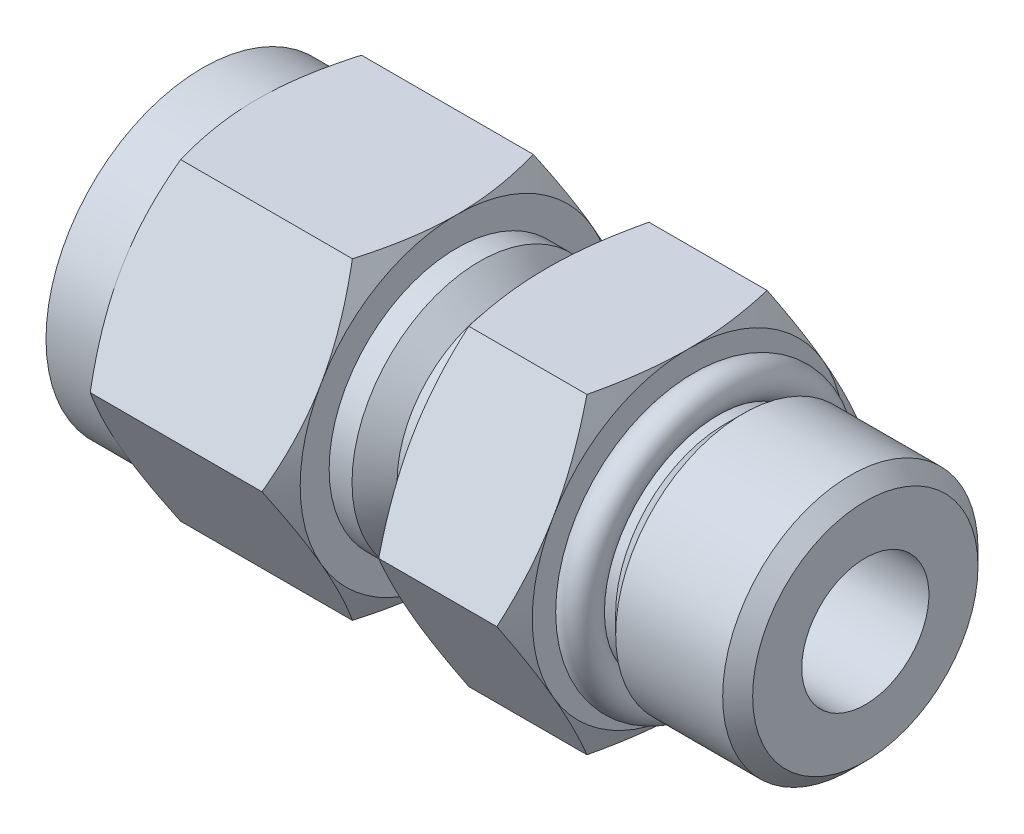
ISO-10303-21;
HEADER;
FILE_DESCRIPTION(('STEP AP214'),'2;1');
FILE_NAME('part.step','',(''),(''),'','','');
FILE_SCHEMA(('AUTOMOTIVE_DESIGN { 1 0 10303 214 1 1 1 1 }'));
ENDSEC;
DATA;
#1=APPLICATION_CONTEXT('core data for automotive mechanical design processes');
#2=APPLICATION_PROTOCOL_DEFINITION('international standard','automotive_design',2000,#1);
#3=PRODUCT_CONTEXT('',#1,'mechanical');
#4=PRODUCT('Part','Part','',(#3));
#5=PRODUCT_RELATED_PRODUCT_CATEGORY('part','',(#4));
#6=PRODUCT_DEFINITION_FORMATION('','',#4);
#7=PRODUCT_DEFINITION_CONTEXT('part definition',#1,'design');
#8=PRODUCT_DEFINITION('design','',#6,#7);
#9=PRODUCT_DEFINITION_SHAPE('','',#8);
#10=(LENGTH_UNIT() NAMED_UNIT(*) SI_UNIT(.MILLI.,.METRE.));
#11=(NAMED_UNIT(*) PLANE_ANGLE_UNIT() SI_UNIT($,.RADIAN.));
#12=(NAMED_UNIT(*) SI_UNIT($,.STERADIAN.) SOLID_ANGLE_UNIT());
#13=UNCERTAINTY_MEASURE_WITH_UNIT(LENGTH_MEASURE(1.E-05),#10,'distance_accuracy_value','');
#14=(GEOMETRIC_REPRESENTATION_CONTEXT(3) GLOBAL_UNCERTAINTY_ASSIGNED_CONTEXT((#13)) GLOBAL_UNIT_ASSIGNED_CONTEXT((#10,
#11,#12)) REPRESENTATION_CONTEXT('',''));
#15=CARTESIAN_POINT('',(0.,0.,0.));
#16=DIRECTION('',(0.,0.,1.));
#17=DIRECTION('',(1.,0.,0.));
#18=AXIS2_PLACEMENT_3D('',#15,#16,#17);
#19=CARTESIAN_POINT('',(-22.86,-8.763,5.05932040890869));
#20=DIRECTION('',(0.,-1.,0.));
#21=DIRECTION('',(0.,0.,-1.));
#22=AXIS2_PLACEMENT_3D('',#19,#20,#21);
#23=PLANE('',#22);
#24=DIRECTION('',(1.,0.,0.));
#25=VECTOR('',#24,1.);
#26=CARTESIAN_POINT('',(-22.86,-8.763,5.05932040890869));
#27=LINE('',#26,#25);
#28=CARTESIAN_POINT('',(-33.2533204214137,-8.76299996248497,5.059320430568));
#29=VERTEX_POINT('',#28);
#30=CARTESIAN_POINT('',(-23.6426795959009,-8.763,5.05932042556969));
#31=VERTEX_POINT('',#30);
#32=EDGE_CURVE('E191',#29,#31,#27,.T.);
#33=ORIENTED_EDGE('',*,*,#32,.F.);
#34=CARTESIAN_POINT('',(-33.2533203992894,-8.763,5.05932044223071));
#35=CARTESIAN_POINT('',(-33.3722343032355,-8.763,4.64749391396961));
#36=CARTESIAN_POINT('',(-33.4811802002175,-8.763,4.23236933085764));
#37=CARTESIAN_POINT('',(-33.6733043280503,-8.763,3.3984608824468));
#38=CARTESIAN_POINT('',(-33.7566099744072,-8.763,2.97970610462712));
#39=CARTESIAN_POINT('',(-33.8588951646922,-8.763,2.34762190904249));
#40=CARTESIAN_POINT('',(-33.8892237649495,-8.763,2.13612871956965));
#41=CARTESIAN_POINT('',(-33.9417232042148,-8.763,1.71212983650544));
#42=CARTESIAN_POINT('',(-33.9638942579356,-8.763,1.49962416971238));
#43=CARTESIAN_POINT('',(-33.9996890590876,-8.763,1.07281429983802));
#44=CARTESIAN_POINT('',(-34.013269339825,-8.76299999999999,0.858506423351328));
#45=CARTESIAN_POINT('',(-34.0314436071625,-8.76299999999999,0.429469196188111));
#46=CARTESIAN_POINT('',(-34.0360358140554,-8.76299999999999,0.214739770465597));
#47=CARTESIAN_POINT('',(-34.036,-8.76299999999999,0.));
#48=B_SPLINE_CURVE_WITH_KNOTS('',3,(#34,#35,#36,#37,#38,#39,#40,#41,#42,#43,#44,#45,#46,#47),
.UNSPECIFIED.,.F.,.F.,(4,2,2,2,2,2,4),(0.,1.28647265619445,2.5664451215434,3.20727114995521,
3.84808031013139,4.49210636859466,5.13625993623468),.UNSPECIFIED.);
#49=CARTESIAN_POINT('',(-34.036,-8.763,0.));
#50=VERTEX_POINT('',#49);
#51=EDGE_CURVE('E674',#29,#50,#48,.T.);
#52=ORIENTED_EDGE('',*,*,#51,.T.);
#53=CARTESIAN_POINT('',(-34.036,-8.76299999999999,0.));
#54=CARTESIAN_POINT('',(-34.0360358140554,-8.76299999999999,-0.214739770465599));
#55=CARTESIAN_POINT('',(-34.0314436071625,-8.76299999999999,-0.429469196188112));
#56=CARTESIAN_POINT('',(-34.013269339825,-8.76299999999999,-0.858506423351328));
#57=CARTESIAN_POINT('',(-33.9996890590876,-8.76299999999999,-1.07281429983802));
#58=CARTESIAN_POINT('',(-33.9638942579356,-8.76299999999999,-1.49962416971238));
#59=CARTESIAN_POINT('',(-33.9417232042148,-8.76299999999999,-1.71212983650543));
#60=CARTESIAN_POINT('',(-33.8892237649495,-8.76299999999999,-2.13612871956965));
#61=CARTESIAN_POINT('',(-33.8588951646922,-8.76299999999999,-2.34762190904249));
#62=CARTESIAN_POINT('',(-33.7566099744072,-8.76299999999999,-2.97970610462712));
#63=CARTESIAN_POINT('',(-33.6733043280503,-8.76299999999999,-3.39846088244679));
#64=CARTESIAN_POINT('',(-33.4811802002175,-8.76299999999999,-4.23236933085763));
#65=CARTESIAN_POINT('',(-33.3722343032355,-8.76299999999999,-4.6474939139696));
#66=CARTESIAN_POINT('',(-33.2533203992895,-8.76299999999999,-5.0593204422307));
#67=B_SPLINE_CURVE_WITH_KNOTS('',3,(#53,#54,#55,#56,#57,#58,#59,#60,#61,#62,#63,#64,#65,#66),
.UNSPECIFIED.,.F.,.F.,(4,2,2,2,2,2,4),(0.,0.64415356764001,1.28817962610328,1.92898878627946,
2.56981481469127,3.84978728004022,5.13625993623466),.UNSPECIFIED.);
#68=CARTESIAN_POINT('',(-33.2533204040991,-8.76299999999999,-5.05932042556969));
#69=VERTEX_POINT('',#68);
#70=EDGE_CURVE('E675',#50,#69,#67,.T.);
#71=ORIENTED_EDGE('',*,*,#70,.T.);
#72=DIRECTION('',(1.,0.,0.));
#73=VECTOR('',#72,1.);
#74=CARTESIAN_POINT('',(-22.86,-8.76299999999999,-5.05932040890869));
#75=LINE('',#74,#73);
#76=CARTESIAN_POINT('',(-23.6426795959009,-8.76300001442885,-5.05932040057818));
#77=VERTEX_POINT('',#76);
#78=EDGE_CURVE('E204',#77,#69,#75,.F.);
#79=ORIENTED_EDGE('',*,*,#78,.F.);
#80=CARTESIAN_POINT('',(-23.6426795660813,-8.76299999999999,-5.05932032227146));
#81=CARTESIAN_POINT('',(-23.5237656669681,-8.76299999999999,-4.64749380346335));
#82=CARTESIAN_POINT('',(-23.4148197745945,-8.76299999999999,-4.23236922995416));
#83=CARTESIAN_POINT('',(-23.2226956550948,-8.76299999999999,-3.39846080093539));
#84=CARTESIAN_POINT('',(-23.1393900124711,-8.76299999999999,-2.97970603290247));
#85=CARTESIAN_POINT('',(-23.0371048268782,-8.76299999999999,-2.34762185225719));
#86=CARTESIAN_POINT('',(-23.0067762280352,-8.76299999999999,-2.13612866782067));
#87=CARTESIAN_POINT('',(-22.9542767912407,-8.76299999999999,-1.71212979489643));
#88=CARTESIAN_POINT('',(-22.9321057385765,-8.76299999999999,-1.49962413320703));
#89=CARTESIAN_POINT('',(-22.8963109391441,-8.76299999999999,-1.07281427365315));
#90=CARTESIAN_POINT('',(-22.8827306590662,-8.76299999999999,-0.858506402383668));
#91=CARTESIAN_POINT('',(-22.8645563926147,-8.76299999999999,-0.429469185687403));
#92=CARTESIAN_POINT('',(-22.859964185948,-8.76299999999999,-0.214739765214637));
#93=CARTESIAN_POINT('',(-22.86,-8.76299999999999,0.));
#94=B_SPLINE_CURVE_WITH_KNOTS('',3,(#80,#81,#82,#83,#84,#85,#86,#87,#88,#89,#90,#91,#92,#93),
.UNSPECIFIED.,.F.,.F.,(4,2,2,2,2,2,4),(0.,1.28647262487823,2.5664450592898,3.20727107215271,
3.84808021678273,4.49210625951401,5.13625981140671),.UNSPECIFIED.);
#95=CARTESIAN_POINT('',(-22.86,-8.763,0.));
#96=VERTEX_POINT('',#95);
#97=EDGE_CURVE('E635',#77,#96,#94,.T.);
#98=ORIENTED_EDGE('',*,*,#97,.T.);
#99=CARTESIAN_POINT('',(-22.86,-8.76299999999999,0.));
#100=CARTESIAN_POINT('',(-22.8599641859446,-8.76299999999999,0.214739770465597));
#101=CARTESIAN_POINT('',(-22.8645563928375,-8.76299999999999,0.42946919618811));
#102=CARTESIAN_POINT('',(-22.882730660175,-8.76299999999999,0.858506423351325));
#103=CARTESIAN_POINT('',(-22.8963109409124,-8.763,1.07281429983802));
#104=CARTESIAN_POINT('',(-22.9321057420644,-8.763,1.49962416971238));
#105=CARTESIAN_POINT('',(-22.9542767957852,-8.763,1.71212983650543));
#106=CARTESIAN_POINT('',(-23.0067762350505,-8.763,2.13612871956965));
#107=CARTESIAN_POINT('',(-23.0371048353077,-8.763,2.34762190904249));
#108=CARTESIAN_POINT('',(-23.1393900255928,-8.763,2.97970610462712));
#109=CARTESIAN_POINT('',(-23.2226956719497,-8.763,3.39846088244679));
#110=CARTESIAN_POINT('',(-23.4148197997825,-8.763,4.23236933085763));
#111=CARTESIAN_POINT('',(-23.5237656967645,-8.763,4.6474939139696));
#112=CARTESIAN_POINT('',(-23.6426796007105,-8.763,5.0593204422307));
#113=B_SPLINE_CURVE_WITH_KNOTS('',3,(#99,#100,#101,#102,#103,#104,#105,#106,#107,#108,#109,#110,
#111,#112),.UNSPECIFIED.,.F.,.F.,(4,2,2,2,2,2,4),(0.,0.644153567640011,1.28817962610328,
1.92898878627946,2.56981481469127,3.84978728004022,5.13625993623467),.UNSPECIFIED.);
#114=EDGE_CURVE('E640',#96,#31,#113,.T.);
#115=ORIENTED_EDGE('',*,*,#114,.T.);
#116=EDGE_LOOP('',(#33,#52,#71,#79,#98,#115));
#117=FACE_BOUND('',#116,.T.);
#118=ADVANCED_FACE('F16',(#117),#23,.T.);
#119=CARTESIAN_POINT('',(-22.86,0.,10.1186408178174));
#120=DIRECTION('',(0.,-0.5,0.866025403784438));
#121=DIRECTION('',(0.,-0.866025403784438,-0.5));
#122=AXIS2_PLACEMENT_3D('',#119,#120,#121);
#123=PLANE('',#122);
#124=CARTESIAN_POINT('',(-22.86,-4.38150000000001,7.58898061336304));
#125=CARTESIAN_POINT('',(-22.8599641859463,-4.19552990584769,7.69635049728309));
#126=CARTESIAN_POINT('',(-22.8645563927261,-4.00956877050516,7.80371520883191));
#127=CARTESIAN_POINT('',(-22.8827306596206,-3.6380116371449,8.01823381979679));
#128=CARTESIAN_POINT('',(-22.8963109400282,-3.45241557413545,8.12538775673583));
#129=CARTESIAN_POINT('',(-22.9321057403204,-3.08278738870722,8.33879268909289));
#130=CARTESIAN_POINT('',(-22.954276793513,-2.89875208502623,8.4450455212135));
#131=CARTESIAN_POINT('',(-23.0067762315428,-2.53155828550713,8.65704496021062));
#132=CARTESIAN_POINT('',(-23.037104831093,-2.34839981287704,8.76279155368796));
#133=CARTESIAN_POINT('',(-23.1393900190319,-1.80099884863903,9.07883364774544));
#134=CARTESIAN_POINT('',(-23.2226956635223,-1.43834657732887,9.28821103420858));
#135=CARTESIAN_POINT('',(-23.4148197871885,-0.716160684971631,9.70516525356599));
#136=CARTESIAN_POINT('',(-23.5237656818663,-0.356652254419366,9.91272754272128));
#137=CARTESIAN_POINT('',(-23.6426795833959,-2.30861681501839E-08,10.1186408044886));
#138=B_SPLINE_CURVE_WITH_KNOTS('',3,(#124,#125,#126,#127,#128,#129,#130,#131,#132,#133,#134,
#135,#136,#137),.UNSPECIFIED.,.F.,.F.,(4,2,2,2,2,2,4),(0.,0.644153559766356,1.28817961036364,
1.92898876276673,2.56981478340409,3.84978723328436,5.1362598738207),.UNSPECIFIED.);
#139=CARTESIAN_POINT('',(-22.86,-4.38150000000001,7.58898061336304));
#140=VERTEX_POINT('',#139);
#141=CARTESIAN_POINT('',(-23.6426795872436,-1.15430873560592E-08,10.118640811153));
#142=VERTEX_POINT('',#141);
#143=EDGE_CURVE('E194',#140,#142,#138,.T.);
#144=ORIENTED_EDGE('',*,*,#143,.T.);
#145=DIRECTION('',(1.,0.,0.));
#146=VECTOR('',#145,1.);
#147=CARTESIAN_POINT('',(-22.86,0.,10.1186408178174));
#148=LINE('',#147,#146);
#149=CARTESIAN_POINT('',(-33.2533204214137,3.75150205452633E-08,10.1186407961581));
#150=VERTEX_POINT('',#149);
#151=EDGE_CURVE('E180',#150,#142,#148,.T.);
#152=ORIENTED_EDGE('',*,*,#151,.F.);
#153=CARTESIAN_POINT('',(-33.2533203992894,2.885770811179E-08,10.1186408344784));
#154=CARTESIAN_POINT('',(-33.3722343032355,-0.356652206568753,9.91272757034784));
#155=CARTESIAN_POINT('',(-33.4811802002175,-0.716160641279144,9.70516527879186));
#156=CARTESIAN_POINT('',(-33.6733043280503,-1.4383465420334,9.28821105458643));
#157=CARTESIAN_POINT('',(-33.7566099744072,-1.80099881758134,9.0788336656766));
#158=CARTESIAN_POINT('',(-33.8588951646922,-2.34839978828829,8.76279156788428));
#159=CARTESIAN_POINT('',(-33.8892237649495,-2.53155826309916,8.65704497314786));
#160=CARTESIAN_POINT('',(-33.9417232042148,-2.898752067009,8.44504553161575));
#161=CARTESIAN_POINT('',(-33.9638942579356,-3.08278737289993,8.33879269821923));
#162=CARTESIAN_POINT('',(-33.9996890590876,-3.45241556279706,8.12538776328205));
#163=CARTESIAN_POINT('',(-34.013269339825,-3.63801162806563,8.0182338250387));
#164=CARTESIAN_POINT('',(-34.0314436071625,-4.00956876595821,7.80371521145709));
#165=CARTESIAN_POINT('',(-34.0360358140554,-4.19552990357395,7.69635049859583));
#166=CARTESIAN_POINT('',(-34.036,-4.3815,7.58898061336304));
#167=B_SPLINE_CURVE_WITH_KNOTS('',3,(#153,#154,#155,#156,#157,#158,#159,#160,#161,#162,#163,
#164,#165,#166),.UNSPECIFIED.,.F.,.F.,(4,2,2,2,2,2,4),(0.,1.28647265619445,2.5664451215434,
3.20727114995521,3.84808031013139,4.49210636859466,5.13625993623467),.UNSPECIFIED.);
#168=CARTESIAN_POINT('',(-34.036,-4.3815,7.58898061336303));
#169=VERTEX_POINT('',#168);
#170=EDGE_CURVE('E659',#150,#169,#167,.T.);
#171=ORIENTED_EDGE('',*,*,#170,.T.);
#172=CARTESIAN_POINT('',(-34.036,-4.3815,7.58898061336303));
#173=CARTESIAN_POINT('',(-34.036035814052,-4.56747009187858,7.48161073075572));
#174=CARTESIAN_POINT('',(-34.0314436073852,-4.75343122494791,7.37424602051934));
#175=CARTESIAN_POINT('',(-34.0132693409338,-5.12498835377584,7.1597274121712));
#176=CARTESIAN_POINT('',(-33.9996890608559,-5.31058441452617,7.05257347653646));
#177=CARTESIAN_POINT('',(-33.9638942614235,-5.6802125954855,6.83916854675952));
#178=CARTESIAN_POINT('',(-33.9417232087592,-5.86424789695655,6.73291571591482));
#179=CARTESIAN_POINT('',(-33.8892237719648,-6.23144169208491,6.5209162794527));
#180=CARTESIAN_POINT('',(-33.8588951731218,-6.4146001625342,6.41516968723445));
#181=CARTESIAN_POINT('',(-33.7566099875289,-6.96200112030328,6.0991275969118));
#182=CARTESIAN_POINT('',(-33.6733043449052,-7.32465338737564,5.88975021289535));
#183=CARTESIAN_POINT('',(-33.4811802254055,-8.04683927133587,5.47279599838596));
#184=CARTESIAN_POINT('',(-33.3722343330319,-8.40634769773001,5.26523371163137));
#185=CARTESIAN_POINT('',(-33.2533204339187,-8.76299992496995,5.05932045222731));
#186=B_SPLINE_CURVE_WITH_KNOTS('',3,(#172,#173,#174,#175,#176,#177,#178,#179,#180,#181,#182,
#183,#184,#185),.UNSPECIFIED.,.F.,.F.,(4,2,2,2,2,2,4),(0.,0.644153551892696,1.28817959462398,
1.92898873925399,2.5698147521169,3.84978718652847,5.13625981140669),.UNSPECIFIED.);
#187=EDGE_CURVE('E667',#169,#29,#186,.T.);
#188=ORIENTED_EDGE('',*,*,#187,.T.);
#189=ORIENTED_EDGE('',*,*,#32,.T.);
#190=CARTESIAN_POINT('',(-23.6426795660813,-8.76299992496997,5.0593204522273));
#191=CARTESIAN_POINT('',(-23.5237656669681,-8.40634769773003,5.26523371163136));
#192=CARTESIAN_POINT('',(-23.4148197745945,-8.04683927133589,5.47279599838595));
#193=CARTESIAN_POINT('',(-23.2226956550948,-7.32465338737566,5.88975021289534));
#194=CARTESIAN_POINT('',(-23.1393900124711,-6.9620011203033,6.0991275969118));
#195=CARTESIAN_POINT('',(-23.0371048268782,-6.41460016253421,6.41516968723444));
#196=CARTESIAN_POINT('',(-23.0067762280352,-6.23144169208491,6.5209162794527));
#197=CARTESIAN_POINT('',(-22.9542767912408,-5.86424789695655,6.73291571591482));
#198=CARTESIAN_POINT('',(-22.9321057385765,-5.68021259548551,6.83916854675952));
#199=CARTESIAN_POINT('',(-22.8963109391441,-5.31058441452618,7.05257347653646));
#200=CARTESIAN_POINT('',(-22.8827306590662,-5.12498835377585,7.1597274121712));
#201=CARTESIAN_POINT('',(-22.8645563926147,-4.75343122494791,7.37424602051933));
#202=CARTESIAN_POINT('',(-22.859964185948,-4.56747009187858,7.48161073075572));
#203=CARTESIAN_POINT('',(-22.86,-4.38150000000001,7.58898061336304));
#204=B_SPLINE_CURVE_WITH_KNOTS('',3,(#190,#191,#192,#193,#194,#195,#196,#197,#198,#199,#200,
#201,#202,#203),.UNSPECIFIED.,.F.,.F.,(4,2,2,2,2,2,4),(0.,1.28647262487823,2.56644505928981,
3.20727107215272,3.84808021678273,4.49210625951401,5.13625981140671),.UNSPECIFIED.);
#205=EDGE_CURVE('E197',#31,#140,#204,.T.);
#206=ORIENTED_EDGE('',*,*,#205,.T.);
#207=EDGE_LOOP('',(#144,#152,#171,#188,#189,#206));
#208=FACE_BOUND('',#207,.T.);
#209=ADVANCED_FACE('F195',(#208),#123,.T.);
#210=CARTESIAN_POINT('',(-22.86,8.76299999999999,5.0593204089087));
#211=DIRECTION('',(0.,0.5,0.866025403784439));
#212=DIRECTION('',(0.,-0.866025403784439,0.5));
#213=AXIS2_PLACEMENT_3D('',#210,#211,#212);
#214=PLANE('',#213);
#215=DIRECTION('',(1.,0.,0.));
#216=VECTOR('',#215,1.);
#217=CARTESIAN_POINT('',(-22.86,8.763,5.05932040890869));
#218=LINE('',#217,#216);
#219=CARTESIAN_POINT('',(-33.2533204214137,8.763,5.05932036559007));
#220=VERTEX_POINT('',#219);
#221=CARTESIAN_POINT('',(-23.6426795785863,8.76299996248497,5.059320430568));
#222=VERTEX_POINT('',#221);
#223=EDGE_CURVE('E190',#220,#222,#218,.T.);
#224=ORIENTED_EDGE('',*,*,#223,.F.);
#225=CARTESIAN_POINT('',(-33.2533203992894,8.76300002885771,5.05932039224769));
#226=CARTESIAN_POINT('',(-33.3722343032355,8.40634779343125,5.26523365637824));
#227=CARTESIAN_POINT('',(-33.4811802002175,8.04683935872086,5.47279594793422));
#228=CARTESIAN_POINT('',(-33.6733043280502,7.3246534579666,5.88975017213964));
#229=CARTESIAN_POINT('',(-33.7566099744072,6.96200118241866,6.09912756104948));
#230=CARTESIAN_POINT('',(-33.8588951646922,6.41460021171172,6.41516965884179));
#231=CARTESIAN_POINT('',(-33.8892237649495,6.23144173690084,6.52091625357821));
#232=CARTESIAN_POINT('',(-33.9417232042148,5.864247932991,6.73291569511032));
#233=CARTESIAN_POINT('',(-33.9638942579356,5.68021262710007,6.83916852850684));
#234=CARTESIAN_POINT('',(-33.9996890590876,5.31058443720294,7.05257346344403));
#235=CARTESIAN_POINT('',(-34.013269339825,5.12498837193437,7.15972740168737));
#236=CARTESIAN_POINT('',(-34.0314436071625,4.75343123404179,7.37424601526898));
#237=CARTESIAN_POINT('',(-34.0360358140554,4.56747009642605,7.48161072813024));
#238=CARTESIAN_POINT('',(-34.036,4.3815,7.58898061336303));
#239=B_SPLINE_CURVE_WITH_KNOTS('',3,(#225,#226,#227,#228,#229,#230,#231,#232,#233,#234,#235,
#236,#237,#238),.UNSPECIFIED.,.F.,.F.,(4,2,2,2,2,2,4),(0.,1.28647265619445,2.56644512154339,
3.2072711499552,3.84808031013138,4.49210636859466,5.13625993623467),.UNSPECIFIED.);
#240=CARTESIAN_POINT('',(-34.036,4.3815,7.58898061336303));
#241=VERTEX_POINT('',#240);
#242=EDGE_CURVE('E1264',#220,#241,#239,.T.);
#243=ORIENTED_EDGE('',*,*,#242,.T.);
#244=CARTESIAN_POINT('',(-34.036,4.3815,7.58898061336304));
#245=CARTESIAN_POINT('',(-34.036035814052,4.19552990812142,7.69635049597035));
#246=CARTESIAN_POINT('',(-34.0314436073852,4.0095687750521,7.80371520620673));
#247=CARTESIAN_POINT('',(-34.0132693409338,3.63801164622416,8.01823381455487));
#248=CARTESIAN_POINT('',(-33.9996890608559,3.45241558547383,8.12538775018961));
#249=CARTESIAN_POINT('',(-33.9638942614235,3.0827874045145,8.33879267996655));
#250=CARTESIAN_POINT('',(-33.9417232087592,2.89875210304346,8.44504551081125));
#251=CARTESIAN_POINT('',(-33.8892237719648,2.53155830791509,8.65704494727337));
#252=CARTESIAN_POINT('',(-33.8588951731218,2.3483998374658,8.76279153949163));
#253=CARTESIAN_POINT('',(-33.7566099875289,1.80099887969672,9.07883362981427));
#254=CARTESIAN_POINT('',(-33.6733043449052,1.43834661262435,9.28821101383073));
#255=CARTESIAN_POINT('',(-33.4811802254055,0.716160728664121,9.70516522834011));
#256=CARTESIAN_POINT('',(-33.3722343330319,0.356652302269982,9.91272751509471));
#257=CARTESIAN_POINT('',(-33.2533204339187,7.50300480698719E-08,10.1186407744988));
#258=B_SPLINE_CURVE_WITH_KNOTS('',3,(#244,#245,#246,#247,#248,#249,#250,#251,#252,#253,#254,
#255,#256,#257),.UNSPECIFIED.,.F.,.F.,(4,2,2,2,2,2,4),(0.,0.644153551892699,1.28817959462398,
1.928988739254,2.5698147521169,3.84978718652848,5.1362598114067),.UNSPECIFIED.);
#259=EDGE_CURVE('E186',#241,#150,#258,.T.);
#260=ORIENTED_EDGE('',*,*,#259,.T.);
#261=ORIENTED_EDGE('',*,*,#151,.T.);
#262=CARTESIAN_POINT('',(-23.6426795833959,2.30861680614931E-08,10.1186408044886));
#263=CARTESIAN_POINT('',(-23.5237656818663,0.356652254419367,9.91272754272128));
#264=CARTESIAN_POINT('',(-23.4148197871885,0.716160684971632,9.70516525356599));
#265=CARTESIAN_POINT('',(-23.2226956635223,1.43834657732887,9.28821103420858));
#266=CARTESIAN_POINT('',(-23.1393900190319,1.80099884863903,9.07883364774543));
#267=CARTESIAN_POINT('',(-23.037104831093,2.34839981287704,8.76279155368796));
#268=CARTESIAN_POINT('',(-23.0067762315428,2.53155828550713,8.65704496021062));
#269=CARTESIAN_POINT('',(-22.954276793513,2.89875208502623,8.4450455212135));
#270=CARTESIAN_POINT('',(-22.9321057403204,3.08278738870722,8.33879268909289));
#271=CARTESIAN_POINT('',(-22.8963109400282,3.45241557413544,8.12538775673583));
#272=CARTESIAN_POINT('',(-22.8827306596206,3.6380116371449,8.01823381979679));
#273=CARTESIAN_POINT('',(-22.8645563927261,4.00956877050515,7.80371520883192));
#274=CARTESIAN_POINT('',(-22.8599641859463,4.19552990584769,7.6963504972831));
#275=CARTESIAN_POINT('',(-22.86,4.3815,7.58898061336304));
#276=B_SPLINE_CURVE_WITH_KNOTS('',3,(#262,#263,#264,#265,#266,#267,#268,#269,#270,#271,#272,
#273,#274,#275),.UNSPECIFIED.,.F.,.F.,(4,2,2,2,2,2,4),(0.,1.28647264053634,2.5664450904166,
3.20727111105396,3.84808026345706,4.49210631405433,5.13625987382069),.UNSPECIFIED.);
#277=CARTESIAN_POINT('',(-22.86,4.3815,7.58898061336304));
#278=VERTEX_POINT('',#277);
#279=EDGE_CURVE('E20',#142,#278,#276,.T.);
#280=ORIENTED_EDGE('',*,*,#279,.T.);
#281=CARTESIAN_POINT('',(-22.86,4.3815,7.58898061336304));
#282=CARTESIAN_POINT('',(-22.859964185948,4.56747009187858,7.48161073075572));
#283=CARTESIAN_POINT('',(-22.8645563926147,4.7534312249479,7.37424602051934));
#284=CARTESIAN_POINT('',(-22.8827306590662,5.12498835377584,7.15972741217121));
#285=CARTESIAN_POINT('',(-22.8963109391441,5.31058441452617,7.05257347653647));
#286=CARTESIAN_POINT('',(-22.9321057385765,5.6802125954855,6.83916854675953));
#287=CARTESIAN_POINT('',(-22.9542767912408,5.86424789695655,6.73291571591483));
#288=CARTESIAN_POINT('',(-23.0067762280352,6.23144169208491,6.52091627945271));
#289=CARTESIAN_POINT('',(-23.0371048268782,6.4146001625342,6.41516968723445));
#290=CARTESIAN_POINT('',(-23.1393900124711,6.96200112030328,6.09912759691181));
#291=CARTESIAN_POINT('',(-23.2226956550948,7.32465338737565,5.88975021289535));
#292=CARTESIAN_POINT('',(-23.4148197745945,8.04683927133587,5.47279599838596));
#293=CARTESIAN_POINT('',(-23.5237656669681,8.40634769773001,5.26523371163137));
#294=CARTESIAN_POINT('',(-23.6426795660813,8.76299992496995,5.05932045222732));
#295=B_SPLINE_CURVE_WITH_KNOTS('',3,(#281,#282,#283,#284,#285,#286,#287,#288,#289,#290,#291,
#292,#293,#294),.UNSPECIFIED.,.F.,.F.,(4,2,2,2,2,2,4),(0.,0.644153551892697,1.28817959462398,
1.92898873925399,2.5698147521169,3.84978718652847,5.13625981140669),.UNSPECIFIED.);
#296=EDGE_CURVE('E705',#278,#222,#295,.T.);
#297=ORIENTED_EDGE('',*,*,#296,.T.);
#298=EDGE_LOOP('',(#224,#243,#260,#261,#280,#297));
#299=FACE_BOUND('',#298,.T.);
#300=ADVANCED_FACE('F182',(#299),#214,.T.);
#301=CARTESIAN_POINT('',(-22.86,8.763,0.));
#302=DIRECTION('',(0.,1.,0.));
#303=DIRECTION('',(0.,0.,1.));
#304=AXIS2_PLACEMENT_3D('',#301,#302,#303);
#305=PLANE('',#304);
#306=DIRECTION('',(1.,0.,0.));
#307=VECTOR('',#306,1.);
#308=CARTESIAN_POINT('',(-22.86,8.763,-5.05932040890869));
#309=LINE('',#308,#307);
#310=CARTESIAN_POINT('',(-33.2533204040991,8.76300001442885,-5.05932040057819));
#311=VERTEX_POINT('',#310);
#312=CARTESIAN_POINT('',(-23.6426795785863,8.763,-5.05932036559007));
#313=VERTEX_POINT('',#312);
#314=EDGE_CURVE('E212',#311,#313,#309,.T.);
#315=ORIENTED_EDGE('',*,*,#314,.F.);
#316=CARTESIAN_POINT('',(-33.2533204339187,8.763,-5.05932032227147));
#317=CARTESIAN_POINT('',(-33.3722343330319,8.763,-4.64749380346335));
#318=CARTESIAN_POINT('',(-33.4811802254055,8.763,-4.23236922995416));
#319=CARTESIAN_POINT('',(-33.6733043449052,8.763,-3.39846080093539));
#320=CARTESIAN_POINT('',(-33.7566099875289,8.763,-2.97970603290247));
#321=CARTESIAN_POINT('',(-33.8588951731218,8.763,-2.34762185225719));
#322=CARTESIAN_POINT('',(-33.8892237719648,8.763,-2.13612866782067));
#323=CARTESIAN_POINT('',(-33.9417232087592,8.763,-1.71212979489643));
#324=CARTESIAN_POINT('',(-33.9638942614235,8.763,-1.49962413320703));
#325=CARTESIAN_POINT('',(-33.9996890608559,8.763,-1.07281427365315));
#326=CARTESIAN_POINT('',(-34.0132693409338,8.763,-0.858506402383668));
#327=CARTESIAN_POINT('',(-34.0314436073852,8.763,-0.429469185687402));
#328=CARTESIAN_POINT('',(-34.036035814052,8.763,-0.214739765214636));
#329=CARTESIAN_POINT('',(-34.036,8.763,0.));
#330=B_SPLINE_CURVE_WITH_KNOTS('',3,(#316,#317,#318,#319,#320,#321,#322,#323,#324,#325,#326,
#327,#328,#329),.UNSPECIFIED.,.F.,.F.,(4,2,2,2,2,2,4),(0.,1.28647262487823,2.5664450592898,
3.20727107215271,3.84808021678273,4.49210625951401,5.13625981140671),.UNSPECIFIED.);
#331=CARTESIAN_POINT('',(-34.036,8.763,0.));
#332=VERTEX_POINT('',#331);
#333=EDGE_CURVE('E1270',#311,#332,#330,.T.);
#334=ORIENTED_EDGE('',*,*,#333,.T.);
#335=CARTESIAN_POINT('',(-34.036,8.763,0.));
#336=CARTESIAN_POINT('',(-34.036035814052,8.763,0.214739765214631));
#337=CARTESIAN_POINT('',(-34.0314436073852,8.763,0.429469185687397));
#338=CARTESIAN_POINT('',(-34.0132693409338,8.763,0.858506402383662));
#339=CARTESIAN_POINT('',(-33.9996890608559,8.763,1.07281427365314));
#340=CARTESIAN_POINT('',(-33.9638942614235,8.763,1.49962413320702));
#341=CARTESIAN_POINT('',(-33.9417232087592,8.763,1.71212979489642));
#342=CARTESIAN_POINT('',(-33.8892237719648,8.763,2.13612866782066));
#343=CARTESIAN_POINT('',(-33.8588951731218,8.763,2.34762185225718));
#344=CARTESIAN_POINT('',(-33.7566099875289,8.763,2.97970603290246));
#345=CARTESIAN_POINT('',(-33.6733043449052,8.763,3.39846080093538));
#346=CARTESIAN_POINT('',(-33.4811802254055,8.763,4.23236922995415));
#347=CARTESIAN_POINT('',(-33.3722343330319,8.763,4.64749380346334));
#348=CARTESIAN_POINT('',(-33.2533204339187,8.763,5.05932032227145));
#349=B_SPLINE_CURVE_WITH_KNOTS('',3,(#335,#336,#337,#338,#339,#340,#341,#342,#343,#344,#345,
#346,#347,#348),.UNSPECIFIED.,.F.,.F.,(4,2,2,2,2,2,4),(0.,0.644153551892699,1.28817959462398,
1.928988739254,2.5698147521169,3.84978718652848,5.1362598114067),.UNSPECIFIED.);
#350=EDGE_CURVE('E1262',#332,#220,#349,.T.);
#351=ORIENTED_EDGE('',*,*,#350,.T.);
#352=ORIENTED_EDGE('',*,*,#223,.T.);
#353=CARTESIAN_POINT('',(-23.6426796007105,8.763,5.05932044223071));
#354=CARTESIAN_POINT('',(-23.5237656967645,8.763,4.64749391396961));
#355=CARTESIAN_POINT('',(-23.4148197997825,8.763,4.23236933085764));
#356=CARTESIAN_POINT('',(-23.2226956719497,8.763,3.3984608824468));
#357=CARTESIAN_POINT('',(-23.1393900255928,8.763,2.97970610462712));
#358=CARTESIAN_POINT('',(-23.0371048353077,8.763,2.34762190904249));
#359=CARTESIAN_POINT('',(-23.0067762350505,8.763,2.13612871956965));
#360=CARTESIAN_POINT('',(-22.9542767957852,8.763,1.71212983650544));
#361=CARTESIAN_POINT('',(-22.9321057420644,8.763,1.49962416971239));
#362=CARTESIAN_POINT('',(-22.8963109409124,8.763,1.07281429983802));
#363=CARTESIAN_POINT('',(-22.882730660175,8.763,0.85850642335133));
#364=CARTESIAN_POINT('',(-22.8645563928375,8.763,0.429469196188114));
#365=CARTESIAN_POINT('',(-22.8599641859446,8.763,0.2147397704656));
#366=CARTESIAN_POINT('',(-22.86,8.763,0.));
#367=B_SPLINE_CURVE_WITH_KNOTS('',3,(#353,#354,#355,#356,#357,#358,#359,#360,#361,#362,#363,
#364,#365,#366),.UNSPECIFIED.,.F.,.F.,(4,2,2,2,2,2,4),(0.,1.28647265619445,2.5664451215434,
3.20727114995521,3.84808031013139,4.49210636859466,5.13625993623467),.UNSPECIFIED.);
#368=CARTESIAN_POINT('',(-22.86,8.763,0.));
#369=VERTEX_POINT('',#368);
#370=EDGE_CURVE('E700',#222,#369,#367,.T.);
#371=ORIENTED_EDGE('',*,*,#370,.T.);
#372=CARTESIAN_POINT('',(-22.86,8.763,0.));
#373=CARTESIAN_POINT('',(-22.859964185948,8.763,-0.214739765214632));
#374=CARTESIAN_POINT('',(-22.8645563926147,8.763,-0.429469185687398));
#375=CARTESIAN_POINT('',(-22.8827306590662,8.763,-0.858506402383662));
#376=CARTESIAN_POINT('',(-22.8963109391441,8.763,-1.07281427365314));
#377=CARTESIAN_POINT('',(-22.9321057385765,8.763,-1.49962413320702));
#378=CARTESIAN_POINT('',(-22.9542767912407,8.763,-1.71212979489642));
#379=CARTESIAN_POINT('',(-23.0067762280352,8.763,-2.13612866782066));
#380=CARTESIAN_POINT('',(-23.0371048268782,8.763,-2.34762185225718));
#381=CARTESIAN_POINT('',(-23.1393900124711,8.763,-2.97970603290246));
#382=CARTESIAN_POINT('',(-23.2226956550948,8.763,-3.39846080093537));
#383=CARTESIAN_POINT('',(-23.4148197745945,8.763,-4.23236922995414));
#384=CARTESIAN_POINT('',(-23.5237656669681,8.763,-4.64749380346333));
#385=CARTESIAN_POINT('',(-23.6426795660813,8.763,-5.05932032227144));
#386=B_SPLINE_CURVE_WITH_KNOTS('',3,(#372,#373,#374,#375,#376,#377,#378,#379,#380,#381,#382,
#383,#384,#385),.UNSPECIFIED.,.F.,.F.,(4,2,2,2,2,2,4),(0.,0.644153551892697,1.28817959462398,
1.92898873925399,2.5698147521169,3.84978718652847,5.13625981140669),.UNSPECIFIED.);
#387=EDGE_CURVE('E604',#369,#313,#386,.T.);
#388=ORIENTED_EDGE('',*,*,#387,.T.);
#389=EDGE_LOOP('',(#315,#334,#351,#352,#371,#388));
#390=FACE_BOUND('',#389,.T.);
#391=ADVANCED_FACE('F718',(#390),#305,.T.);
#392=CARTESIAN_POINT('',(-22.86,0.,-10.1186408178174));
#393=DIRECTION('',(0.,0.5,-0.866025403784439));
#394=DIRECTION('',(0.,0.866025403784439,0.5));
#395=AXIS2_PLACEMENT_3D('',#392,#393,#394);
#396=PLANE('',#395);
#397=CARTESIAN_POINT('',(-22.86,4.3815,-7.58898061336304));
#398=CARTESIAN_POINT('',(-22.859964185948,4.19552990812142,-7.69635049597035));
#399=CARTESIAN_POINT('',(-22.8645563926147,4.00956877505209,-7.80371520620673));
#400=CARTESIAN_POINT('',(-22.8827306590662,3.63801164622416,-8.01823381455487));
#401=CARTESIAN_POINT('',(-22.8963109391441,3.45241558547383,-8.1253877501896));
#402=CARTESIAN_POINT('',(-22.9321057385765,3.0827874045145,-8.33879267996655));
#403=CARTESIAN_POINT('',(-22.9542767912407,2.89875210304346,-8.44504551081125));
#404=CARTESIAN_POINT('',(-23.0067762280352,2.53155830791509,-8.65704494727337));
#405=CARTESIAN_POINT('',(-23.0371048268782,2.3483998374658,-8.76279153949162));
#406=CARTESIAN_POINT('',(-23.1393900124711,1.80099887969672,-9.07883362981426));
#407=CARTESIAN_POINT('',(-23.2226956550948,1.43834661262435,-9.28821101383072));
#408=CARTESIAN_POINT('',(-23.4148197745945,0.716160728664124,-9.70516522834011));
#409=CARTESIAN_POINT('',(-23.5237656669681,0.356652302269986,-9.9127275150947));
#410=CARTESIAN_POINT('',(-23.6426795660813,7.50300513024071E-08,-10.1186407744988));
#411=B_SPLINE_CURVE_WITH_KNOTS('',3,(#397,#398,#399,#400,#401,#402,#403,#404,#405,#406,#407,
#408,#409,#410),.UNSPECIFIED.,.F.,.F.,(4,2,2,2,2,2,4),(0.,0.644153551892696,1.28817959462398,
1.92898873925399,2.5698147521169,3.84978718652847,5.13625981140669),.UNSPECIFIED.);
#412=CARTESIAN_POINT('',(-22.86,4.3815,-7.58898061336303));
#413=VERTEX_POINT('',#412);
#414=CARTESIAN_POINT('',(-23.6426795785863,3.75150264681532E-08,-10.1186407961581));
#415=VERTEX_POINT('',#414);
#416=EDGE_CURVE('E605',#413,#415,#411,.T.);
#417=ORIENTED_EDGE('',*,*,#416,.T.);
#418=DIRECTION('',(1.,0.,0.));
#419=VECTOR('',#418,1.);
#420=CARTESIAN_POINT('',(-22.86,0.,-10.1186408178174));
#421=LINE('',#420,#419);
#422=CARTESIAN_POINT('',(-33.2533204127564,-1.15430810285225E-08,-10.118640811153));
#423=VERTEX_POINT('',#422);
#424=EDGE_CURVE('E205',#423,#415,#421,.T.);
#425=ORIENTED_EDGE('',*,*,#424,.F.);
#426=CARTESIAN_POINT('',(-33.2533204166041,2.30861648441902E-08,-10.1186408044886));
#427=CARTESIAN_POINT('',(-33.3722343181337,0.356652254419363,-9.91272754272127));
#428=CARTESIAN_POINT('',(-33.4811802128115,0.716160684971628,-9.70516525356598));
#429=CARTESIAN_POINT('',(-33.6733043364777,1.43834657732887,-9.28821103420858));
#430=CARTESIAN_POINT('',(-33.756609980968,1.80099884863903,-9.07883364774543));
#431=CARTESIAN_POINT('',(-33.858895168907,2.34839981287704,-8.76279155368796));
#432=CARTESIAN_POINT('',(-33.8892237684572,2.53155828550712,-8.65704496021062));
#433=CARTESIAN_POINT('',(-33.941723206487,2.89875208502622,-8.4450455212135));
#434=CARTESIAN_POINT('',(-33.9638942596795,3.08278738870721,-8.33879268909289));
#435=CARTESIAN_POINT('',(-33.9996890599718,3.45241557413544,-8.12538775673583));
#436=CARTESIAN_POINT('',(-34.0132693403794,3.63801163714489,-8.01823381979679));
#437=CARTESIAN_POINT('',(-34.0314436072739,4.00956877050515,-7.80371520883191));
#438=CARTESIAN_POINT('',(-34.0360358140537,4.19552990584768,-7.69635049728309));
#439=CARTESIAN_POINT('',(-34.036,4.3815,-7.58898061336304));
#440=B_SPLINE_CURVE_WITH_KNOTS('',3,(#426,#427,#428,#429,#430,#431,#432,#433,#434,#435,#436,
#437,#438,#439),.UNSPECIFIED.,.F.,.F.,(4,2,2,2,2,2,4),(0.,1.28647264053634,2.5664450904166,
3.20727111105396,3.84808026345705,4.49210631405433,5.13625987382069),.UNSPECIFIED.);
#441=CARTESIAN_POINT('',(-34.036,4.3815,-7.58898061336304));
#442=VERTEX_POINT('',#441);
#443=EDGE_CURVE('E566',#423,#442,#440,.T.);
#444=ORIENTED_EDGE('',*,*,#443,.T.);
#445=CARTESIAN_POINT('',(-34.036,4.3815,-7.58898061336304));
#446=CARTESIAN_POINT('',(-34.0360358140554,4.56747009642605,-7.48161072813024));
#447=CARTESIAN_POINT('',(-34.0314436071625,4.75343123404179,-7.37424601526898));
#448=CARTESIAN_POINT('',(-34.013269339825,5.12498837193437,-7.15972740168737));
#449=CARTESIAN_POINT('',(-33.9996890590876,5.31058443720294,-7.05257346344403));
#450=CARTESIAN_POINT('',(-33.9638942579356,5.68021262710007,-6.83916852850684));
#451=CARTESIAN_POINT('',(-33.9417232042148,5.864247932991,-6.73291569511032));
#452=CARTESIAN_POINT('',(-33.8892237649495,6.23144173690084,-6.52091625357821));
#453=CARTESIAN_POINT('',(-33.8588951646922,6.41460021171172,-6.41516965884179));
#454=CARTESIAN_POINT('',(-33.7566099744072,6.96200118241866,-6.09912756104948));
#455=CARTESIAN_POINT('',(-33.6733043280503,7.3246534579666,-5.88975017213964));
#456=CARTESIAN_POINT('',(-33.4811802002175,8.04683935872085,-5.47279594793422));
#457=CARTESIAN_POINT('',(-33.3722343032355,8.40634779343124,-5.26523365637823));
#458=CARTESIAN_POINT('',(-33.2533203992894,8.76300002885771,-5.05932039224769));
#459=B_SPLINE_CURVE_WITH_KNOTS('',3,(#445,#446,#447,#448,#449,#450,#451,#452,#453,#454,#455,
#456,#457,#458),.UNSPECIFIED.,.F.,.F.,(4,2,2,2,2,2,4),(0.,0.644153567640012,1.28817962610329,
1.92898878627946,2.56981481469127,3.84978728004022,5.13625993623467),.UNSPECIFIED.);
#460=EDGE_CURVE('E724',#442,#311,#459,.T.);
#461=ORIENTED_EDGE('',*,*,#460,.T.);
#462=ORIENTED_EDGE('',*,*,#314,.T.);
#463=CARTESIAN_POINT('',(-23.6426796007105,8.76300002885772,-5.05932039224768));
#464=CARTESIAN_POINT('',(-23.5237656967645,8.40634779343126,-5.26523365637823));
#465=CARTESIAN_POINT('',(-23.4148197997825,8.04683935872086,-5.47279594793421));
#466=CARTESIAN_POINT('',(-23.2226956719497,7.32465345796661,-5.88975017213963));
#467=CARTESIAN_POINT('',(-23.1393900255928,6.96200118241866,-6.09912756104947));
#468=CARTESIAN_POINT('',(-23.0371048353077,6.41460021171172,-6.41516965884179));
#469=CARTESIAN_POINT('',(-23.0067762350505,6.23144173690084,-6.52091625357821));
#470=CARTESIAN_POINT('',(-22.9542767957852,5.86424793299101,-6.73291569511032));
#471=CARTESIAN_POINT('',(-22.9321057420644,5.68021262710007,-6.83916852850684));
#472=CARTESIAN_POINT('',(-22.8963109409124,5.31058443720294,-7.05257346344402));
#473=CARTESIAN_POINT('',(-22.882730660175,5.12498837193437,-7.15972740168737));
#474=CARTESIAN_POINT('',(-22.8645563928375,4.75343123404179,-7.37424601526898));
#475=CARTESIAN_POINT('',(-22.8599641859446,4.56747009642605,-7.48161072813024));
#476=CARTESIAN_POINT('',(-22.86,4.3815,-7.58898061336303));
#477=B_SPLINE_CURVE_WITH_KNOTS('',3,(#463,#464,#465,#466,#467,#468,#469,#470,#471,#472,#473,
#474,#475,#476),.UNSPECIFIED.,.F.,.F.,(4,2,2,2,2,2,4),(0.,1.28647265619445,2.5664451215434,
3.20727114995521,3.84808031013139,4.49210636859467,5.13625993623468),.UNSPECIFIED.);
#478=EDGE_CURVE('E709',#313,#413,#477,.T.);
#479=ORIENTED_EDGE('',*,*,#478,.T.);
#480=EDGE_LOOP('',(#417,#425,#444,#461,#462,#479));
#481=FACE_BOUND('',#480,.T.);
#482=ADVANCED_FACE('F579',(#481),#396,.T.);
#483=CARTESIAN_POINT('',(-22.86,-8.76299999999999,-5.05932040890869));
#484=DIRECTION('',(0.,-0.5,-0.866025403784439));
#485=DIRECTION('',(0.,0.866025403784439,-0.5));
#486=AXIS2_PLACEMENT_3D('',#483,#484,#485);
#487=PLANE('',#486);
#488=CARTESIAN_POINT('',(-22.86,-4.3815,-7.58898061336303));
#489=CARTESIAN_POINT('',(-22.8599641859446,-4.56747009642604,-7.48161072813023));
#490=CARTESIAN_POINT('',(-22.8645563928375,-4.75343123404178,-7.37424601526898));
#491=CARTESIAN_POINT('',(-22.882730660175,-5.12498837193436,-7.15972740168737));
#492=CARTESIAN_POINT('',(-22.8963109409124,-5.31058443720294,-7.05257346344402));
#493=CARTESIAN_POINT('',(-22.9321057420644,-5.68021262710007,-6.83916852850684));
#494=CARTESIAN_POINT('',(-22.9542767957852,-5.864247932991,-6.73291569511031));
#495=CARTESIAN_POINT('',(-23.0067762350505,-6.23144173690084,-6.52091625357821));
#496=CARTESIAN_POINT('',(-23.0371048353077,-6.41460021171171,-6.41516965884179));
#497=CARTESIAN_POINT('',(-23.1393900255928,-6.96200118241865,-6.09912756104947));
#498=CARTESIAN_POINT('',(-23.2226956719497,-7.3246534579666,-5.88975017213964));
#499=CARTESIAN_POINT('',(-23.4148197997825,-8.04683935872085,-5.47279594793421));
#500=CARTESIAN_POINT('',(-23.5237656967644,-8.40634779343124,-5.26523365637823));
#501=CARTESIAN_POINT('',(-23.6426796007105,-8.7630000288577,-5.05932039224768));
#502=B_SPLINE_CURVE_WITH_KNOTS('',3,(#488,#489,#490,#491,#492,#493,#494,#495,#496,#497,#498,
#499,#500,#501),.UNSPECIFIED.,.F.,.F.,(4,2,2,2,2,2,4),(0.,0.644153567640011,1.28817962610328,
1.92898878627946,2.56981481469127,3.84978728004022,5.13625993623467),.UNSPECIFIED.);
#503=CARTESIAN_POINT('',(-22.86,-4.3815,-7.58898061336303));
#504=VERTEX_POINT('',#503);
#505=EDGE_CURVE('E630',#504,#77,#502,.T.);
#506=ORIENTED_EDGE('',*,*,#505,.T.);
#507=ORIENTED_EDGE('',*,*,#78,.T.);
#508=CARTESIAN_POINT('',(-33.2533204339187,-8.76299992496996,-5.0593204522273));
#509=CARTESIAN_POINT('',(-33.3722343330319,-8.40634769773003,-5.26523371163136));
#510=CARTESIAN_POINT('',(-33.4811802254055,-8.04683927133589,-5.47279599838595));
#511=CARTESIAN_POINT('',(-33.6733043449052,-7.32465338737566,-5.88975021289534));
#512=CARTESIAN_POINT('',(-33.7566099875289,-6.96200112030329,-6.0991275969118));
#513=CARTESIAN_POINT('',(-33.8588951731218,-6.4146001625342,-6.41516968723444));
#514=CARTESIAN_POINT('',(-33.8892237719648,-6.23144169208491,-6.5209162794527));
#515=CARTESIAN_POINT('',(-33.9417232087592,-5.86424789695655,-6.73291571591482));
#516=CARTESIAN_POINT('',(-33.9638942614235,-5.6802125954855,-6.83916854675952));
#517=CARTESIAN_POINT('',(-33.9996890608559,-5.31058441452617,-7.05257347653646));
#518=CARTESIAN_POINT('',(-34.0132693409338,-5.12498835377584,-7.1597274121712));
#519=CARTESIAN_POINT('',(-34.0314436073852,-4.7534312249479,-7.37424602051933));
#520=CARTESIAN_POINT('',(-34.036035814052,-4.56747009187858,-7.48161073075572));
#521=CARTESIAN_POINT('',(-34.036,-4.3815,-7.58898061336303));
#522=B_SPLINE_CURVE_WITH_KNOTS('',3,(#508,#509,#510,#511,#512,#513,#514,#515,#516,#517,#518,
#519,#520,#521),.UNSPECIFIED.,.F.,.F.,(4,2,2,2,2,2,4),(0.,1.28647262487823,2.56644505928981,
3.20727107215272,3.84808021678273,4.49210625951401,5.13625981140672),.UNSPECIFIED.);
#523=CARTESIAN_POINT('',(-34.036,-4.3815,-7.58898061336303));
#524=VERTEX_POINT('',#523);
#525=EDGE_CURVE('E589',#69,#524,#522,.T.);
#526=ORIENTED_EDGE('',*,*,#525,.T.);
#527=CARTESIAN_POINT('',(-34.036,-4.3815,-7.58898061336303));
#528=CARTESIAN_POINT('',(-34.0360358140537,-4.19552990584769,-7.69635049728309));
#529=CARTESIAN_POINT('',(-34.0314436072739,-4.00956877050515,-7.80371520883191));
#530=CARTESIAN_POINT('',(-34.0132693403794,-3.6380116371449,-8.01823381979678));
#531=CARTESIAN_POINT('',(-33.9996890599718,-3.45241557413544,-8.12538775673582));
#532=CARTESIAN_POINT('',(-33.9638942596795,-3.08278738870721,-8.33879268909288));
#533=CARTESIAN_POINT('',(-33.941723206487,-2.89875208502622,-8.4450455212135));
#534=CARTESIAN_POINT('',(-33.8892237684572,-2.53155828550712,-8.65704496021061));
#535=CARTESIAN_POINT('',(-33.858895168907,-2.34839981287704,-8.76279155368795));
#536=CARTESIAN_POINT('',(-33.756609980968,-1.80099884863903,-9.07883364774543));
#537=CARTESIAN_POINT('',(-33.6733043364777,-1.43834657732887,-9.28821103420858));
#538=CARTESIAN_POINT('',(-33.4811802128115,-0.716160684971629,-9.70516525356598));
#539=CARTESIAN_POINT('',(-33.3722343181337,-0.356652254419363,-9.91272754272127));
#540=CARTESIAN_POINT('',(-33.2533204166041,-2.30861639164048E-08,-10.1186408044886));
#541=B_SPLINE_CURVE_WITH_KNOTS('',3,(#527,#528,#529,#530,#531,#532,#533,#534,#535,#536,#537,
#538,#539,#540),.UNSPECIFIED.,.F.,.F.,(4,2,2,2,2,2,4),(0.,0.644153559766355,1.28817961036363,
1.92898876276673,2.56981478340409,3.84978723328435,5.13625987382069),.UNSPECIFIED.);
#542=EDGE_CURVE('E558',#524,#423,#541,.T.);
#543=ORIENTED_EDGE('',*,*,#542,.T.);
#544=ORIENTED_EDGE('',*,*,#424,.T.);
#545=CARTESIAN_POINT('',(-23.6426796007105,2.8857717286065E-08,-10.1186408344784));
#546=CARTESIAN_POINT('',(-23.5237656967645,-0.356652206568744,-9.91272757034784));
#547=CARTESIAN_POINT('',(-23.4148197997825,-0.716160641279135,-9.70516527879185));
#548=CARTESIAN_POINT('',(-23.2226956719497,-1.43834654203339,-9.28821105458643));
#549=CARTESIAN_POINT('',(-23.1393900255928,-1.80099881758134,-9.0788336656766));
#550=CARTESIAN_POINT('',(-23.0371048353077,-2.34839978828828,-8.76279156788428));
#551=CARTESIAN_POINT('',(-23.0067762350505,-2.53155826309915,-8.65704497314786));
#552=CARTESIAN_POINT('',(-22.9542767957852,-2.89875206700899,-8.44504553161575));
#553=CARTESIAN_POINT('',(-22.9321057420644,-3.08278737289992,-8.33879269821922));
#554=CARTESIAN_POINT('',(-22.8963109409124,-3.45241556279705,-8.12538776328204));
#555=CARTESIAN_POINT('',(-22.882730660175,-3.63801162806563,-8.0182338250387));
#556=CARTESIAN_POINT('',(-22.8645563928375,-4.00956876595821,-7.80371521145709));
#557=CARTESIAN_POINT('',(-22.8599641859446,-4.19552990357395,-7.69635049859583));
#558=CARTESIAN_POINT('',(-22.86,-4.3815,-7.58898061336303));
#559=B_SPLINE_CURVE_WITH_KNOTS('',3,(#545,#546,#547,#548,#549,#550,#551,#552,#553,#554,#555,
#556,#557,#558),.UNSPECIFIED.,.F.,.F.,(4,2,2,2,2,2,4),(0.,1.28647265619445,2.5664451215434,
3.20727114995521,3.84808031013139,4.49210636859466,5.13625993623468),.UNSPECIFIED.);
#560=EDGE_CURVE('E597',#415,#504,#559,.T.);
#561=ORIENTED_EDGE('',*,*,#560,.T.);
#562=EDGE_LOOP('',(#506,#507,#526,#543,#544,#561));
#563=FACE_BOUND('',#562,.T.);
#564=ADVANCED_FACE('F576',(#563),#487,.T.);
#565=CARTESIAN_POINT('',(-22.86,0.,0.));
#566=DIRECTION('',(-1.,0.,0.));
#567=DIRECTION('',(0.,0.,1.));
#568=AXIS2_PLACEMENT_3D('',#565,#566,#567);
#569=CONICAL_SURFACE('',#568,8.763,1.0471975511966);
#570=CARTESIAN_POINT('',(-22.86,0.,0.));
#571=DIRECTION('',(-1.,0.,0.));
#572=DIRECTION('',(0.,0.,1.));
#573=AXIS2_PLACEMENT_3D('',#570,#571,#572);
#574=CIRCLE('',#573,8.763);
#575=EDGE_CURVE('E202',#278,#140,#574,.F.);
#576=ORIENTED_EDGE('',*,*,#575,.F.);
#577=ORIENTED_EDGE('',*,*,#279,.F.);
#578=ORIENTED_EDGE('',*,*,#143,.F.);
#579=EDGE_LOOP('',(#576,#577,#578));
#580=FACE_BOUND('',#579,.T.);
#581=ADVANCED_FACE('F200',(#580),#569,.T.);
#582=CARTESIAN_POINT('',(-22.86,0.,0.));
#583=DIRECTION('',(-1.,0.,0.));
#584=DIRECTION('',(0.,0.,1.));
#585=AXIS2_PLACEMENT_3D('',#582,#583,#584);
#586=CONICAL_SURFACE('',#585,8.763,1.0471975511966);
#587=CARTESIAN_POINT('',(-22.86,0.,0.));
#588=DIRECTION('',(-1.,0.,0.));
#589=DIRECTION('',(0.,0.,1.));
#590=AXIS2_PLACEMENT_3D('',#587,#588,#589);
#591=CIRCLE('',#590,8.763);
#592=EDGE_CURVE('E554',#140,#96,#591,.F.);
#593=ORIENTED_EDGE('',*,*,#592,.F.);
#594=ORIENTED_EDGE('',*,*,#205,.F.);
#595=ORIENTED_EDGE('',*,*,#114,.F.);
#596=EDGE_LOOP('',(#593,#594,#595));
#597=FACE_BOUND('',#596,.T.);
#598=ADVANCED_FACE('F626',(#597),#586,.T.);
#599=CARTESIAN_POINT('',(-22.86,0.,0.));
#600=DIRECTION('',(-1.,0.,0.));
#601=DIRECTION('',(0.,0.,1.));
#602=AXIS2_PLACEMENT_3D('',#599,#600,#601);
#603=CONICAL_SURFACE('',#602,8.763,1.0471975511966);
#604=CARTESIAN_POINT('',(-22.86,0.,0.));
#605=DIRECTION('',(-1.,0.,0.));
#606=DIRECTION('',(0.,0.,1.));
#607=AXIS2_PLACEMENT_3D('',#604,#605,#606);
#608=CIRCLE('',#607,8.763);
#609=EDGE_CURVE('E551',#96,#504,#608,.F.);
#610=ORIENTED_EDGE('',*,*,#609,.F.);
#611=ORIENTED_EDGE('',*,*,#97,.F.);
#612=ORIENTED_EDGE('',*,*,#505,.F.);
#613=EDGE_LOOP('',(#610,#611,#612));
#614=FACE_BOUND('',#613,.T.);
#615=ADVANCED_FACE('F619',(#614),#603,.T.);
#616=CARTESIAN_POINT('',(-22.86,0.,0.));
#617=DIRECTION('',(-1.,0.,0.));
#618=DIRECTION('',(0.,0.,1.));
#619=AXIS2_PLACEMENT_3D('',#616,#617,#618);
#620=CONICAL_SURFACE('',#619,8.763,1.0471975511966);
#621=ORIENTED_EDGE('',*,*,#416,.F.);
#622=CARTESIAN_POINT('',(-22.86,0.,0.));
#623=DIRECTION('',(-1.,0.,0.));
#624=DIRECTION('',(0.,0.,1.));
#625=AXIS2_PLACEMENT_3D('',#622,#623,#624);
#626=CIRCLE('',#625,8.763);
#627=EDGE_CURVE('E544',#504,#413,#626,.F.);
#628=ORIENTED_EDGE('',*,*,#627,.F.);
#629=ORIENTED_EDGE('',*,*,#560,.F.);
#630=EDGE_LOOP('',(#621,#628,#629));
#631=FACE_BOUND('',#630,.T.);
#632=ADVANCED_FACE('F614',(#631),#620,.T.);
#633=CARTESIAN_POINT('',(-22.86,0.,0.));
#634=DIRECTION('',(-1.,0.,0.));
#635=DIRECTION('',(0.,0.,1.));
#636=AXIS2_PLACEMENT_3D('',#633,#634,#635);
#637=CONICAL_SURFACE('',#636,8.763,1.0471975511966);
#638=ORIENTED_EDGE('',*,*,#387,.F.);
#639=CARTESIAN_POINT('',(-22.86,0.,0.));
#640=DIRECTION('',(-1.,0.,0.));
#641=DIRECTION('',(0.,0.,1.));
#642=AXIS2_PLACEMENT_3D('',#639,#640,#641);
#643=CIRCLE('',#642,8.763);
#644=EDGE_CURVE('E539',#413,#369,#643,.F.);
#645=ORIENTED_EDGE('',*,*,#644,.F.);
#646=ORIENTED_EDGE('',*,*,#478,.F.);
#647=EDGE_LOOP('',(#638,#645,#646));
#648=FACE_BOUND('',#647,.T.);
#649=ADVANCED_FACE('F618',(#648),#637,.T.);
#650=CARTESIAN_POINT('',(-22.86,0.,0.));
#651=DIRECTION('',(-1.,0.,0.));
#652=DIRECTION('',(0.,0.,1.));
#653=AXIS2_PLACEMENT_3D('',#650,#651,#652);
#654=CONICAL_SURFACE('',#653,8.763,1.0471975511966);
#655=ORIENTED_EDGE('',*,*,#296,.F.);
#656=CARTESIAN_POINT('',(-22.86,0.,0.));
#657=DIRECTION('',(-1.,0.,0.));
#658=DIRECTION('',(0.,0.,1.));
#659=AXIS2_PLACEMENT_3D('',#656,#657,#658);
#660=CIRCLE('',#659,8.763);
#661=EDGE_CURVE('E536',#369,#278,#660,.F.);
#662=ORIENTED_EDGE('',*,*,#661,.F.);
#663=ORIENTED_EDGE('',*,*,#370,.F.);
#664=EDGE_LOOP('',(#655,#662,#663));
#665=FACE_BOUND('',#664,.T.);
#666=ADVANCED_FACE('F693',(#665),#654,.T.);
#667=CARTESIAN_POINT('',(-34.036,0.,0.));
#668=DIRECTION('',(1.,0.,0.));
#669=DIRECTION('',(0.,0.,-1.));
#670=AXIS2_PLACEMENT_3D('',#667,#668,#669);
#671=CONICAL_SURFACE('',#670,8.763,1.0471975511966);
#672=CARTESIAN_POINT('',(-34.036,0.,0.));
#673=DIRECTION('',(1.,0.,0.));
#674=DIRECTION('',(0.,0.,-1.));
#675=AXIS2_PLACEMENT_3D('',#672,#673,#674);
#676=CIRCLE('',#675,8.763);
#677=EDGE_CURVE('E215',#524,#50,#676,.F.);
#678=ORIENTED_EDGE('',*,*,#677,.F.);
#679=ORIENTED_EDGE('',*,*,#525,.F.);
#680=ORIENTED_EDGE('',*,*,#70,.F.);
#681=EDGE_LOOP('',(#678,#679,#680));
#682=FACE_BOUND('',#681,.T.);
#683=ADVANCED_FACE('F686',(#682),#671,.T.);
#684=CARTESIAN_POINT('',(-34.036,0.,0.));
#685=DIRECTION('',(1.,0.,0.));
#686=DIRECTION('',(0.,0.,-1.));
#687=AXIS2_PLACEMENT_3D('',#684,#685,#686);
#688=CONICAL_SURFACE('',#687,8.763,1.0471975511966);
#689=ORIENTED_EDGE('',*,*,#187,.F.);
#690=CARTESIAN_POINT('',(-34.036,0.,0.));
#691=DIRECTION('',(1.,0.,0.));
#692=DIRECTION('',(0.,0.,-1.));
#693=AXIS2_PLACEMENT_3D('',#690,#691,#692);
#694=CIRCLE('',#693,8.763);
#695=EDGE_CURVE('E530',#50,#169,#694,.F.);
#696=ORIENTED_EDGE('',*,*,#695,.F.);
#697=ORIENTED_EDGE('',*,*,#51,.F.);
#698=EDGE_LOOP('',(#689,#696,#697));
#699=FACE_BOUND('',#698,.T.);
#700=ADVANCED_FACE('F682',(#699),#688,.T.);
#701=CARTESIAN_POINT('',(-34.036,0.,0.));
#702=DIRECTION('',(1.,0.,0.));
#703=DIRECTION('',(0.,0.,-1.));
#704=AXIS2_PLACEMENT_3D('',#701,#702,#703);
#705=CONICAL_SURFACE('',#704,8.763,1.0471975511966);
#706=ORIENTED_EDGE('',*,*,#259,.F.);
#707=CARTESIAN_POINT('',(-34.036,0.,0.));
#708=DIRECTION('',(1.,0.,0.));
#709=DIRECTION('',(0.,0.,-1.));
#710=AXIS2_PLACEMENT_3D('',#707,#708,#709);
#711=CIRCLE('',#710,8.763);
#712=EDGE_CURVE('E527',#169,#241,#711,.F.);
#713=ORIENTED_EDGE('',*,*,#712,.F.);
#714=ORIENTED_EDGE('',*,*,#170,.F.);
#715=EDGE_LOOP('',(#706,#713,#714));
#716=FACE_BOUND('',#715,.T.);
#717=ADVANCED_FACE('F685',(#716),#705,.T.);
#718=CARTESIAN_POINT('',(-34.036,0.,0.));
#719=DIRECTION('',(1.,0.,0.));
#720=DIRECTION('',(0.,0.,-1.));
#721=AXIS2_PLACEMENT_3D('',#718,#719,#720);
#722=CONICAL_SURFACE('',#721,8.763,1.0471975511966);
#723=ORIENTED_EDGE('',*,*,#350,.F.);
#724=CARTESIAN_POINT('',(-34.036,0.,0.));
#725=DIRECTION('',(1.,0.,0.));
#726=DIRECTION('',(0.,0.,-1.));
#727=AXIS2_PLACEMENT_3D('',#724,#725,#726);
#728=CIRCLE('',#727,8.763);
#729=EDGE_CURVE('E524',#241,#332,#728,.F.);
#730=ORIENTED_EDGE('',*,*,#729,.F.);
#731=ORIENTED_EDGE('',*,*,#242,.F.);
#732=EDGE_LOOP('',(#723,#730,#731));
#733=FACE_BOUND('',#732,.T.);
#734=ADVANCED_FACE('F833',(#733),#722,.T.);
#735=CARTESIAN_POINT('',(-34.036,0.,0.));
#736=DIRECTION('',(1.,0.,0.));
#737=DIRECTION('',(0.,0.,-1.));
#738=AXIS2_PLACEMENT_3D('',#735,#736,#737);
#739=CONICAL_SURFACE('',#738,8.763,1.0471975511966);
#740=CARTESIAN_POINT('',(-34.036,0.,0.));
#741=DIRECTION('',(1.,0.,0.));
#742=DIRECTION('',(0.,0.,-1.));
#743=AXIS2_PLACEMENT_3D('',#740,#741,#742);
#744=CIRCLE('',#743,8.763);
#745=EDGE_CURVE('E519',#332,#442,#744,.F.);
#746=ORIENTED_EDGE('',*,*,#745,.F.);
#747=ORIENTED_EDGE('',*,*,#333,.F.);
#748=ORIENTED_EDGE('',*,*,#460,.F.);
#749=EDGE_LOOP('',(#746,#747,#748));
#750=FACE_BOUND('',#749,.T.);
#751=ADVANCED_FACE('F841',(#750),#739,.T.);
#752=CARTESIAN_POINT('',(-34.036,0.,0.));
#753=DIRECTION('',(1.,0.,0.));
#754=DIRECTION('',(0.,0.,-1.));
#755=AXIS2_PLACEMENT_3D('',#752,#753,#754);
#756=CONICAL_SURFACE('',#755,8.763,1.0471975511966);
#757=ORIENTED_EDGE('',*,*,#542,.F.);
#758=CARTESIAN_POINT('',(-34.036,0.,0.));
#759=DIRECTION('',(1.,0.,0.));
#760=DIRECTION('',(0.,0.,-1.));
#761=AXIS2_PLACEMENT_3D('',#758,#759,#760);
#762=CIRCLE('',#761,8.763);
#763=EDGE_CURVE('E516',#442,#524,#762,.F.);
#764=ORIENTED_EDGE('',*,*,#763,.F.);
#765=ORIENTED_EDGE('',*,*,#443,.F.);
#766=EDGE_LOOP('',(#757,#764,#765));
#767=FACE_BOUND('',#766,.T.);
#768=ADVANCED_FACE('F572',(#767),#756,.T.);
#769=CARTESIAN_POINT('',(-22.86,0.,7.953375));
#770=DIRECTION('',(1.,0.,0.));
#771=DIRECTION('',(0.,1.,0.));
#772=AXIS2_PLACEMENT_3D('',#769,#770,#771);
#773=PLANE('',#772);
#774=CARTESIAN_POINT('',(-22.86,0.,0.));
#775=DIRECTION('',(1.,0.,0.));
#776=DIRECTION('',(0.,0.,-1.));
#777=AXIS2_PLACEMENT_3D('',#774,#775,#776);
#778=CIRCLE('',#777,7.14375);
#779=CARTESIAN_POINT('',(-22.86,0.,-7.14375));
#780=VERTEX_POINT('',#779);
#781=EDGE_CURVE('E518',#780,#780,#778,.T.);
#782=ORIENTED_EDGE('',*,*,#781,.F.);
#783=EDGE_LOOP('',(#782));
#784=FACE_BOUND('',#783,.T.);
#785=ORIENTED_EDGE('',*,*,#644,.T.);
#786=ORIENTED_EDGE('',*,*,#661,.T.);
#787=ORIENTED_EDGE('',*,*,#575,.T.);
#788=ORIENTED_EDGE('',*,*,#592,.T.);
#789=ORIENTED_EDGE('',*,*,#609,.T.);
#790=ORIENTED_EDGE('',*,*,#627,.T.);
#791=EDGE_LOOP('',(#785,#786,#787,#788,#789,#790));
#792=FACE_BOUND('',#791,.T.);
#793=ADVANCED_FACE('F727',(#784,#792),#773,.T.);
#794=CARTESIAN_POINT('',(-28.448,0.,0.));
#795=DIRECTION('',(1.,0.,0.));
#796=DIRECTION('',(0.,0.,-1.));
#797=AXIS2_PLACEMENT_3D('',#794,#795,#796);
#798=CYLINDRICAL_SURFACE('',#797,8.763);
#799=ORIENTED_EDGE('',*,*,#695,.T.);
#800=ORIENTED_EDGE('',*,*,#712,.T.);
#801=ORIENTED_EDGE('',*,*,#729,.T.);
#802=ORIENTED_EDGE('',*,*,#745,.T.);
#803=ORIENTED_EDGE('',*,*,#763,.T.);
#804=ORIENTED_EDGE('',*,*,#677,.T.);
#805=EDGE_LOOP('',(#799,#800,#801,#802,#803,#804));
#806=FACE_BOUND('',#805,.T.);
#807=CARTESIAN_POINT('',(-37.084,0.,0.));
#808=DIRECTION('',(1.,0.,0.));
#809=DIRECTION('',(0.,0.,-1.));
#810=AXIS2_PLACEMENT_3D('',#807,#808,#809);
#811=CIRCLE('',#810,8.763);
#812=CARTESIAN_POINT('',(-37.084,0.,-8.763));
#813=VERTEX_POINT('',#812);
#814=EDGE_CURVE('E515',#813,#813,#811,.F.);
#815=ORIENTED_EDGE('',*,*,#814,.F.);
#816=EDGE_LOOP('',(#815));
#817=FACE_BOUND('',#816,.T.);
#818=ADVANCED_FACE('F863',(#806,#817),#798,.T.);
#819=CARTESIAN_POINT('',(-22.21992,0.,0.));
#820=DIRECTION('',(1.,0.,0.));
#821=DIRECTION('',(0.,0.,-1.));
#822=AXIS2_PLACEMENT_3D('',#819,#820,#821);
#823=CYLINDRICAL_SURFACE('',#822,7.14375);
#824=ORIENTED_EDGE('',*,*,#781,.T.);
#825=EDGE_LOOP('',(#824));
#826=FACE_BOUND('',#825,.T.);
#827=CARTESIAN_POINT('',(-21.5798400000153,0.,0.));
#828=DIRECTION('',(-1.,0.,0.));
#829=DIRECTION('',(0.,0.,1.));
#830=AXIS2_PLACEMENT_3D('',#827,#828,#829);
#831=CIRCLE('',#830,7.14375000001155);
#832=CARTESIAN_POINT('',(-21.5798400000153,0.,7.14375000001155));
#833=VERTEX_POINT('',#832);
#834=EDGE_CURVE('E512',#833,#833,#831,.F.);
#835=ORIENTED_EDGE('',*,*,#834,.F.);
#836=EDGE_LOOP('',(#835));
#837=FACE_BOUND('',#836,.T.);
#838=ADVANCED_FACE('F871',(#826,#837),#823,.T.);
#839=CARTESIAN_POINT('',(-37.084,0.,4.3815));
#840=DIRECTION('',(-1.,0.,0.));
#841=DIRECTION('',(0.,0.,1.));
#842=AXIS2_PLACEMENT_3D('',#839,#840,#841);
#843=PLANE('',#842);
#844=ORIENTED_EDGE('',*,*,#814,.T.);
#845=EDGE_LOOP('',(#844));
#846=FACE_BOUND('',#845,.T.);
#847=CARTESIAN_POINT('',(-37.084,0.,0.));
#848=DIRECTION('',(1.,0.,0.));
#849=DIRECTION('',(0.,0.,-1.));
#850=AXIS2_PLACEMENT_3D('',#847,#848,#849);
#851=CIRCLE('',#850,4.7625);
#852=CARTESIAN_POINT('',(-37.084,0.,-4.7625));
#853=VERTEX_POINT('',#852);
#854=EDGE_CURVE('E511',#853,#853,#851,.T.);
#855=ORIENTED_EDGE('',*,*,#854,.T.);
#856=EDGE_LOOP('',(#855));
#857=FACE_BOUND('',#856,.T.);
#858=ADVANCED_FACE('F879',(#846,#857),#843,.T.);
#859=CARTESIAN_POINT('',(-21.5798400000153,0.,0.));
#860=DIRECTION('',(-1.,0.,0.));
#861=DIRECTION('',(0.,0.,1.));
#862=AXIS2_PLACEMENT_3D('',#859,#860,#861);
#863=CONICAL_SURFACE('',#862,7.14375000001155,0.785398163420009);
#864=ORIENTED_EDGE('',*,*,#834,.T.);
#865=EDGE_LOOP('',(#864));
#866=FACE_BOUND('',#865,.T.);
#867=CARTESIAN_POINT('',(-20.32,0.,0.));
#868=DIRECTION('',(1.,0.,0.));
#869=DIRECTION('',(0.,0.,-1.));
#870=AXIS2_PLACEMENT_3D('',#867,#868,#869);
#871=CIRCLE('',#870,5.88391);
#872=CARTESIAN_POINT('',(-20.32,0.,-5.88391));
#873=VERTEX_POINT('',#872);
#874=EDGE_CURVE('E507',#873,#873,#871,.T.);
#875=ORIENTED_EDGE('',*,*,#874,.F.);
#876=EDGE_LOOP('',(#875));
#877=FACE_BOUND('',#876,.T.);
#878=ADVANCED_FACE('F888',(#866,#877),#863,.T.);
#879=CARTESIAN_POINT('',(-28.702,0.,0.));
#880=DIRECTION('',(1.,0.,0.));
#881=DIRECTION('',(0.,0.,-1.));
#882=AXIS2_PLACEMENT_3D('',#879,#880,#881);
#883=CYLINDRICAL_SURFACE('',#882,4.7625);
#884=CARTESIAN_POINT('',(-20.32,0.,0.));
#885=DIRECTION('',(1.,0.,0.));
#886=DIRECTION('',(0.,0.,-1.));
#887=AXIS2_PLACEMENT_3D('',#884,#885,#886);
#888=CIRCLE('',#887,4.7625);
#889=CARTESIAN_POINT('',(-20.32,0.,-4.7625));
#890=VERTEX_POINT('',#889);
#891=EDGE_CURVE('E510',#890,#890,#888,.T.);
#892=ORIENTED_EDGE('',*,*,#891,.T.);
#893=EDGE_LOOP('',(#892));
#894=FACE_BOUND('',#893,.T.);
#895=ORIENTED_EDGE('',*,*,#854,.F.);
#896=EDGE_LOOP('',(#895));
#897=FACE_BOUND('',#896,.T.);
#898=ADVANCED_FACE('F897',(#894,#897),#883,.F.);
#899=CARTESIAN_POINT('',(-19.05,0.,0.));
#900=DIRECTION('',(1.,0.,0.));
#901=DIRECTION('',(0.,0.,-1.));
#902=AXIS2_PLACEMENT_3D('',#899,#900,#901);
#903=CYLINDRICAL_SURFACE('',#902,5.88391);
#904=ORIENTED_EDGE('',*,*,#874,.T.);
#905=EDGE_LOOP('',(#904));
#906=FACE_BOUND('',#905,.T.);
#907=CARTESIAN_POINT('',(-17.78,0.,0.));
#908=DIRECTION('',(1.,0.,0.));
#909=DIRECTION('',(0.,0.,-1.));
#910=AXIS2_PLACEMENT_3D('',#907,#908,#909);
#911=CIRCLE('',#910,5.88391);
#912=CARTESIAN_POINT('',(-17.78,0.,-5.88391));
#913=VERTEX_POINT('',#912);
#914=EDGE_CURVE('E1185',#913,#913,#911,.F.);
#915=ORIENTED_EDGE('',*,*,#914,.T.);
#916=EDGE_LOOP('',(#915));
#917=FACE_BOUND('',#916,.T.);
#918=ADVANCED_FACE('F906',(#906,#917),#903,.T.);
#919=CARTESIAN_POINT('',(-20.32,0.,0.));
#920=DIRECTION('',(1.,0.,0.));
#921=DIRECTION('',(0.,0.,-1.));
#922=AXIS2_PLACEMENT_3D('',#919,#920,#921);
#923=PLANE('',#922);
#924=ORIENTED_EDGE('',*,*,#891,.F.);
#925=EDGE_LOOP('',(#924));
#926=FACE_BOUND('',#925,.T.);
#927=CARTESIAN_POINT('',(-20.32,0.,0.));
#928=DIRECTION('',(-1.,0.,0.));
#929=DIRECTION('',(0.,0.,1.));
#930=AXIS2_PLACEMENT_3D('',#927,#928,#929);
#931=CIRCLE('',#930,3.556);
#932=CARTESIAN_POINT('',(-20.32,0.,3.556));
#933=VERTEX_POINT('',#932);
#934=EDGE_CURVE('E1182',#933,#933,#931,.F.);
#935=ORIENTED_EDGE('',*,*,#934,.T.);
#936=EDGE_LOOP('',(#935));
#937=FACE_BOUND('',#936,.T.);
#938=ADVANCED_FACE('F915',(#926,#937),#923,.F.);
#939=CARTESIAN_POINT('',(-17.78,0.,0.));
#940=DIRECTION('',(1.,0.,0.));
#941=DIRECTION('',(0.,1.,0.));
#942=AXIS2_PLACEMENT_3D('',#939,#940,#941);
#943=PLANE('',#942);
#944=CARTESIAN_POINT('',(-17.78,0.,0.));
#945=DIRECTION('',(1.,0.,0.));
#946=DIRECTION('',(0.,0.,-1.));
#947=AXIS2_PLACEMENT_3D('',#944,#945,#946);
#948=CIRCLE('',#947,8.73125);
#949=CARTESIAN_POINT('',(-17.78,4.365625,7.56148430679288));
#950=VERTEX_POINT('',#949);
#951=CARTESIAN_POINT('',(-17.78,8.73125,0.));
#952=VERTEX_POINT('',#951);
#953=EDGE_CURVE('E1176',#950,#952,#948,.F.);
#954=ORIENTED_EDGE('',*,*,#953,.T.);
#955=CARTESIAN_POINT('',(-17.78,0.,0.));
#956=DIRECTION('',(1.,0.,0.));
#957=DIRECTION('',(0.,0.,-1.));
#958=AXIS2_PLACEMENT_3D('',#955,#956,#957);
#959=CIRCLE('',#958,8.73125);
#960=CARTESIAN_POINT('',(-17.78,4.365625,-7.56148430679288));
#961=VERTEX_POINT('',#960);
#962=EDGE_CURVE('E1178',#952,#961,#959,.F.);
#963=ORIENTED_EDGE('',*,*,#962,.T.);
#964=CARTESIAN_POINT('',(-17.78,0.,0.));
#965=DIRECTION('',(1.,0.,0.));
#966=DIRECTION('',(0.,0.,-1.));
#967=AXIS2_PLACEMENT_3D('',#964,#965,#966);
#968=CIRCLE('',#967,8.73125);
#969=CARTESIAN_POINT('',(-17.78,-4.365625,-7.56148430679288));
#970=VERTEX_POINT('',#969);
#971=EDGE_CURVE('E1180',#961,#970,#968,.F.);
#972=ORIENTED_EDGE('',*,*,#971,.T.);
#973=CARTESIAN_POINT('',(-17.78,0.,0.));
#974=DIRECTION('',(1.,0.,0.));
#975=DIRECTION('',(0.,0.,-1.));
#976=AXIS2_PLACEMENT_3D('',#973,#974,#975);
#977=CIRCLE('',#976,8.73125);
#978=CARTESIAN_POINT('',(-17.78,-8.73125,0.));
#979=VERTEX_POINT('',#978);
#980=EDGE_CURVE('E1172',#970,#979,#977,.F.);
#981=ORIENTED_EDGE('',*,*,#980,.T.);
#982=CARTESIAN_POINT('',(-17.78,0.,0.));
#983=DIRECTION('',(1.,0.,0.));
#984=DIRECTION('',(0.,0.,-1.));
#985=AXIS2_PLACEMENT_3D('',#982,#983,#984);
#986=CIRCLE('',#985,8.73125);
#987=CARTESIAN_POINT('',(-17.78,-4.365625,7.56148430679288));
#988=VERTEX_POINT('',#987);
#989=EDGE_CURVE('E1168',#979,#988,#986,.F.);
#990=ORIENTED_EDGE('',*,*,#989,.T.);
#991=CARTESIAN_POINT('',(-17.78,0.,0.));
#992=DIRECTION('',(1.,0.,0.));
#993=DIRECTION('',(0.,0.,-1.));
#994=AXIS2_PLACEMENT_3D('',#991,#992,#993);
#995=CIRCLE('',#994,8.73125);
#996=EDGE_CURVE('E1169',#988,#950,#995,.F.);
#997=ORIENTED_EDGE('',*,*,#996,.T.);
#998=EDGE_LOOP('',(#954,#963,#972,#981,#990,#997));
#999=FACE_BOUND('',#998,.T.);
#1000=ORIENTED_EDGE('',*,*,#914,.F.);
#1001=EDGE_LOOP('',(#1000));
#1002=FACE_BOUND('',#1001,.T.);
#1003=ADVANCED_FACE('F924',(#999,#1002),#943,.F.);
#1004=CARTESIAN_POINT('',(-13.843,0.,0.));
#1005=DIRECTION('',(-1.,0.,0.));
#1006=DIRECTION('',(0.,0.,1.));
#1007=AXIS2_PLACEMENT_3D('',#1004,#1005,#1006);
#1008=CYLINDRICAL_SURFACE('',#1007,3.556);
#1009=CARTESIAN_POINT('',(0.,0.,0.));
#1010=DIRECTION('',(-1.,0.,0.));
#1011=DIRECTION('',(0.,0.,1.));
#1012=AXIS2_PLACEMENT_3D('',#1009,#1010,#1011);
#1013=CIRCLE('',#1012,3.556);
#1014=CARTESIAN_POINT('',(0.,0.,3.556));
#1015=VERTEX_POINT('',#1014);
#1016=EDGE_CURVE('E452',#1015,#1015,#1013,.T.);
#1017=ORIENTED_EDGE('',*,*,#1016,.F.);
#1018=EDGE_LOOP('',(#1017));
#1019=FACE_BOUND('',#1018,.T.);
#1020=ORIENTED_EDGE('',*,*,#934,.F.);
#1021=EDGE_LOOP('',(#1020));
#1022=FACE_BOUND('',#1021,.T.);
#1023=ADVANCED_FACE('F436',(#1019,#1022),#1008,.F.);
#1024=CARTESIAN_POINT('',(-17.78,0.,0.));
#1025=DIRECTION('',(1.,0.,0.));
#1026=DIRECTION('',(0.,0.,-1.));
#1027=AXIS2_PLACEMENT_3D('',#1024,#1025,#1026);
#1028=CONICAL_SURFACE('',#1027,8.73125,1.13446401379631);
#1029=ORIENTED_EDGE('',*,*,#971,.F.);
#1030=CARTESIAN_POINT('',(-17.1501446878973,0.,-10.0819790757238));
#1031=CARTESIAN_POINT('',(-17.2466106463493,0.358182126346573,-9.87518252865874));
#1032=CARTESIAN_POINT('',(-17.3346465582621,0.718294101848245,-9.66727178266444));
#1033=CARTESIAN_POINT('',(-17.4896147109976,1.44062744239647,-9.25023243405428));
#1034=CARTESIAN_POINT('',(-17.5566168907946,1.80283764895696,-9.04111027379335));
#1035=CARTESIAN_POINT('',(-17.6386592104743,2.34838811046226,-8.72613656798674));
#1036=CARTESIAN_POINT('',(-17.662936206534,2.5306886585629,-8.62088529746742));
#1037=CARTESIAN_POINT('',(-17.7049115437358,2.89585880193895,-8.41005421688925));
#1038=CARTESIAN_POINT('',(-17.7226099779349,3.0787283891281,-8.30447441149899));
#1039=CARTESIAN_POINT('',(-17.7511319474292,3.44548500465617,-8.09272738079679));
#1040=CARTESIAN_POINT('',(-17.7619323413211,3.62937339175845,-7.98655937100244));
#1041=CARTESIAN_POINT('',(-17.7763793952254,3.99738110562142,-7.77409001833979));
#1042=CARTESIAN_POINT('',(-17.780025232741,4.18150045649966,-7.66778866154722));
#1043=CARTESIAN_POINT('',(-17.78,4.365625,-7.56148430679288));
#1044=B_SPLINE_CURVE_WITH_KNOTS('',3,(#1030,#1031,#1032,#1033,#1034,#1035,#1036,#1037,#1038,
#1039,#1040,#1041,#1042,#1043),.UNSPECIFIED.,.F.,.F.,(4,2,2,2,2,2,4),(0.,1.27440302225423,
2.54452252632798,3.18012218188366,3.81571284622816,4.45342472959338,5.0912099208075),.UNSPECIFIED.);
#1045=CARTESIAN_POINT('',(-17.1501446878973,0.,-10.0819790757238));
#1046=VERTEX_POINT('',#1045);
#1047=EDGE_CURVE('E415',#1046,#961,#1044,.T.);
#1048=ORIENTED_EDGE('',*,*,#1047,.F.);
#1049=CARTESIAN_POINT('',(-17.78,-4.365625,-7.56148430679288));
#1050=CARTESIAN_POINT('',(-17.780025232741,-4.18150045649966,-7.66778866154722));
#1051=CARTESIAN_POINT('',(-17.7763793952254,-3.99738110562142,-7.77409001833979));
#1052=CARTESIAN_POINT('',(-17.7619323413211,-3.62937339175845,-7.98655937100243));
#1053=CARTESIAN_POINT('',(-17.7511319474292,-3.44548500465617,-8.09272738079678));
#1054=CARTESIAN_POINT('',(-17.7226099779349,-3.0787283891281,-8.30447441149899));
#1055=CARTESIAN_POINT('',(-17.7049115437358,-2.89585880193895,-8.41005421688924));
#1056=CARTESIAN_POINT('',(-17.662936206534,-2.53068865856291,-8.62088529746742));
#1057=CARTESIAN_POINT('',(-17.6386592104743,-2.34838811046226,-8.72613656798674));
#1058=CARTESIAN_POINT('',(-17.5566168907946,-1.80283764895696,-9.04111027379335));
#1059=CARTESIAN_POINT('',(-17.4896147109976,-1.44062744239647,-9.25023243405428));
#1060=CARTESIAN_POINT('',(-17.3346465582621,-0.718294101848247,-9.66727178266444));
#1061=CARTESIAN_POINT('',(-17.2466106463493,-0.358182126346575,-9.87518252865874));
#1062=CARTESIAN_POINT('',(-17.1501446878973,0.,-10.0819790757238));
#1063=B_SPLINE_CURVE_WITH_KNOTS('',3,(#1049,#1050,#1051,#1052,#1053,#1054,#1055,#1056,#1057,
#1058,#1059,#1060,#1061,#1062),.UNSPECIFIED.,.F.,.F.,(4,2,2,2,2,2,4),(0.,0.637785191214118,
1.27549707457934,1.91108773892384,2.54668739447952,3.81680689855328,5.09120992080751),.UNSPECIFIED.);
#1064=EDGE_CURVE('E440',#970,#1046,#1063,.T.);
#1065=ORIENTED_EDGE('',*,*,#1064,.F.);
#1066=EDGE_LOOP('',(#1029,#1048,#1065));
#1067=FACE_BOUND('',#1066,.T.);
#1068=ADVANCED_FACE('F429',(#1067),#1028,.T.);
#1069=CARTESIAN_POINT('',(-17.78,0.,0.));
#1070=DIRECTION('',(1.,0.,0.));
#1071=DIRECTION('',(0.,0.,-1.));
#1072=AXIS2_PLACEMENT_3D('',#1069,#1070,#1071);
#1073=CONICAL_SURFACE('',#1072,8.73125,1.13446401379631);
#1074=ORIENTED_EDGE('',*,*,#962,.F.);
#1075=CARTESIAN_POINT('',(-17.1501446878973,8.73125,-5.04098953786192));
#1076=CARTESIAN_POINT('',(-17.2466106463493,8.73125,-4.62739644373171));
#1077=CARTESIAN_POINT('',(-17.3346465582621,8.73125,-4.21157495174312));
#1078=CARTESIAN_POINT('',(-17.4896147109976,8.73125,-3.3774962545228));
#1079=CARTESIAN_POINT('',(-17.5566168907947,8.73125,-2.95925193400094));
#1080=CARTESIAN_POINT('',(-17.6386592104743,8.73125,-2.32930452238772));
#1081=CARTESIAN_POINT('',(-17.662936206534,8.73125,-2.11880198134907));
#1082=CARTESIAN_POINT('',(-17.7049115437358,8.73125,-1.69713982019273));
#1083=CARTESIAN_POINT('',(-17.7226099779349,8.73125,-1.48598020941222));
#1084=CARTESIAN_POINT('',(-17.7511319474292,8.73125,-1.06248614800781));
#1085=CARTESIAN_POINT('',(-17.7619323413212,8.73125,-0.85015012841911));
#1086=CARTESIAN_POINT('',(-17.7763793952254,8.73125,-0.425211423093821));
#1087=CARTESIAN_POINT('',(-17.780025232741,8.73125,-0.212608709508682));
#1088=CARTESIAN_POINT('',(-17.78,8.73125,0.));
#1089=B_SPLINE_CURVE_WITH_KNOTS('',3,(#1075,#1076,#1077,#1078,#1079,#1080,#1081,#1082,#1083,
#1084,#1085,#1086,#1087,#1088),.UNSPECIFIED.,.F.,.F.,(4,2,2,2,2,2,4),(0.,1.27440302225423,
2.54452252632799,3.18012218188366,3.81571284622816,4.45342472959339,5.09120992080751),.UNSPECIFIED.);
#1090=CARTESIAN_POINT('',(-17.1501446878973,8.73125,-5.04098953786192));
#1091=VERTEX_POINT('',#1090);
#1092=EDGE_CURVE('E416',#1091,#952,#1089,.T.);
#1093=ORIENTED_EDGE('',*,*,#1092,.F.);
#1094=CARTESIAN_POINT('',(-17.78,4.365625,-7.56148430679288));
#1095=CARTESIAN_POINT('',(-17.780025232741,4.54974954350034,-7.45517995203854));
#1096=CARTESIAN_POINT('',(-17.7763793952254,4.73386889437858,-7.34887859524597));
#1097=CARTESIAN_POINT('',(-17.7619323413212,5.10187660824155,-7.13640924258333));
#1098=CARTESIAN_POINT('',(-17.7511319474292,5.28576499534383,-7.03024123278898));
#1099=CARTESIAN_POINT('',(-17.7226099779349,5.6525216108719,-6.81849420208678));
#1100=CARTESIAN_POINT('',(-17.7049115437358,5.83539119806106,-6.71291439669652));
#1101=CARTESIAN_POINT('',(-17.662936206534,6.2005613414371,-6.50208331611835));
#1102=CARTESIAN_POINT('',(-17.6386592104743,6.38286188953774,-6.39683204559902));
#1103=CARTESIAN_POINT('',(-17.5566168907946,6.92841235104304,-6.08185833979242));
#1104=CARTESIAN_POINT('',(-17.4896147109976,7.29062255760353,-5.87273617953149));
#1105=CARTESIAN_POINT('',(-17.3346465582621,8.01295589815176,-5.45569683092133));
#1106=CARTESIAN_POINT('',(-17.2466106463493,8.37306787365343,-5.24778608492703));
#1107=CARTESIAN_POINT('',(-17.1501446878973,8.73125,-5.04098953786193));
#1108=B_SPLINE_CURVE_WITH_KNOTS('',3,(#1094,#1095,#1096,#1097,#1098,#1099,#1100,#1101,#1102,
#1103,#1104,#1105,#1106,#1107),.UNSPECIFIED.,.F.,.F.,(4,2,2,2,2,2,4),(0.,0.637785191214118,
1.27549707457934,1.91108773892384,2.54668739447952,3.81680689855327,5.0912099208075),.UNSPECIFIED.);
#1109=EDGE_CURVE('E408',#961,#1091,#1108,.T.);
#1110=ORIENTED_EDGE('',*,*,#1109,.F.);
#1111=EDGE_LOOP('',(#1074,#1093,#1110));
#1112=FACE_BOUND('',#1111,.T.);
#1113=ADVANCED_FACE('F425',(#1112),#1073,.T.);
#1114=CARTESIAN_POINT('',(-17.78,0.,0.));
#1115=DIRECTION('',(1.,0.,0.));
#1116=DIRECTION('',(0.,0.,-1.));
#1117=AXIS2_PLACEMENT_3D('',#1114,#1115,#1116);
#1118=CONICAL_SURFACE('',#1117,8.73125,1.13446401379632);
#1119=ORIENTED_EDGE('',*,*,#953,.F.);
#1120=CARTESIAN_POINT('',(-17.1501446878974,8.73125,5.04098953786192));
#1121=CARTESIAN_POINT('',(-17.2466106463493,8.37306787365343,5.24778608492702));
#1122=CARTESIAN_POINT('',(-17.3346465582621,8.01295589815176,5.45569683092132));
#1123=CARTESIAN_POINT('',(-17.4896147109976,7.29062255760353,5.87273617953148));
#1124=CARTESIAN_POINT('',(-17.5566168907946,6.92841235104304,6.08185833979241));
#1125=CARTESIAN_POINT('',(-17.6386592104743,6.38286188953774,6.39683204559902));
#1126=CARTESIAN_POINT('',(-17.662936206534,6.2005613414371,6.50208331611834));
#1127=CARTESIAN_POINT('',(-17.7049115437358,5.83539119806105,6.71291439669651));
#1128=CARTESIAN_POINT('',(-17.7226099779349,5.6525216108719,6.81849420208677));
#1129=CARTESIAN_POINT('',(-17.7511319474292,5.28576499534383,7.03024123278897));
#1130=CARTESIAN_POINT('',(-17.7619323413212,5.10187660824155,7.13640924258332));
#1131=CARTESIAN_POINT('',(-17.7763793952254,4.73386889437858,7.34887859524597));
#1132=CARTESIAN_POINT('',(-17.780025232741,4.54974954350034,7.45517995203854));
#1133=CARTESIAN_POINT('',(-17.78,4.365625,7.56148430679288));
#1134=B_SPLINE_CURVE_WITH_KNOTS('',3,(#1120,#1121,#1122,#1123,#1124,#1125,#1126,#1127,#1128,
#1129,#1130,#1131,#1132,#1133),.UNSPECIFIED.,.F.,.F.,(4,2,2,2,2,2,4),(0.,1.27440302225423,
2.54452252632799,3.18012218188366,3.81571284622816,4.45342472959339,5.09120992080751),.UNSPECIFIED.);
#1135=CARTESIAN_POINT('',(-17.1501446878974,8.73125,5.04098953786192));
#1136=VERTEX_POINT('',#1135);
#1137=EDGE_CURVE('E326',#1136,#950,#1134,.T.);
#1138=ORIENTED_EDGE('',*,*,#1137,.F.);
#1139=CARTESIAN_POINT('',(-17.78,8.73125,0.));
#1140=CARTESIAN_POINT('',(-17.780025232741,8.73125,0.212608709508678));
#1141=CARTESIAN_POINT('',(-17.7763793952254,8.73125,0.425211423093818));
#1142=CARTESIAN_POINT('',(-17.7619323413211,8.73125,0.850150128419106));
#1143=CARTESIAN_POINT('',(-17.7511319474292,8.73125,1.06248614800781));
#1144=CARTESIAN_POINT('',(-17.7226099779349,8.73125,1.48598020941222));
#1145=CARTESIAN_POINT('',(-17.7049115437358,8.73125,1.69713982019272));
#1146=CARTESIAN_POINT('',(-17.662936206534,8.73125,2.11880198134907));
#1147=CARTESIAN_POINT('',(-17.6386592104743,8.73125,2.32930452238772));
#1148=CARTESIAN_POINT('',(-17.5566168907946,8.73125,2.95925193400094));
#1149=CARTESIAN_POINT('',(-17.4896147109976,8.73125,3.37749625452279));
#1150=CARTESIAN_POINT('',(-17.3346465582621,8.73125,4.21157495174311));
#1151=CARTESIAN_POINT('',(-17.2466106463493,8.73125,4.62739644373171));
#1152=CARTESIAN_POINT('',(-17.1501446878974,8.73125,5.04098953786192));
#1153=B_SPLINE_CURVE_WITH_KNOTS('',3,(#1139,#1140,#1141,#1142,#1143,#1144,#1145,#1146,#1147,
#1148,#1149,#1150,#1151,#1152),.UNSPECIFIED.,.F.,.F.,(4,2,2,2,2,2,4),(0.,0.637785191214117,
1.27549707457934,1.91108773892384,2.54668739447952,3.81680689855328,5.0912099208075),.UNSPECIFIED.);
#1154=EDGE_CURVE('E500',#952,#1136,#1153,.T.);
#1155=ORIENTED_EDGE('',*,*,#1154,.F.);
#1156=EDGE_LOOP('',(#1119,#1138,#1155));
#1157=FACE_BOUND('',#1156,.T.);
#1158=ADVANCED_FACE('F428',(#1157),#1118,.T.);
#1159=CARTESIAN_POINT('',(-17.78,0.,0.));
#1160=DIRECTION('',(1.,0.,0.));
#1161=DIRECTION('',(0.,0.,-1.));
#1162=AXIS2_PLACEMENT_3D('',#1159,#1160,#1161);
#1163=CONICAL_SURFACE('',#1162,8.73125,1.13446401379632);
#1164=CARTESIAN_POINT('',(-17.78,-8.73124999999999,0.));
#1165=CARTESIAN_POINT('',(-17.780025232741,-8.73124999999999,-0.212608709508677));
#1166=CARTESIAN_POINT('',(-17.7763793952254,-8.73124999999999,-0.425211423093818));
#1167=CARTESIAN_POINT('',(-17.7619323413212,-8.73124999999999,-0.850150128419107));
#1168=CARTESIAN_POINT('',(-17.7511319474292,-8.73125,-1.06248614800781));
#1169=CARTESIAN_POINT('',(-17.7226099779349,-8.73125,-1.48598020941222));
#1170=CARTESIAN_POINT('',(-17.7049115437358,-8.73125,-1.69713982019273));
#1171=CARTESIAN_POINT('',(-17.662936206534,-8.73125,-2.11880198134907));
#1172=CARTESIAN_POINT('',(-17.6386592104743,-8.73125,-2.32930452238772));
#1173=CARTESIAN_POINT('',(-17.5566168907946,-8.73125,-2.95925193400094));
#1174=CARTESIAN_POINT('',(-17.4896147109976,-8.73125,-3.37749625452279));
#1175=CARTESIAN_POINT('',(-17.3346465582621,-8.73125,-4.21157495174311));
#1176=CARTESIAN_POINT('',(-17.2466106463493,-8.73125,-4.62739644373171));
#1177=CARTESIAN_POINT('',(-17.1501446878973,-8.73125,-5.04098953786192));
#1178=B_SPLINE_CURVE_WITH_KNOTS('',3,(#1164,#1165,#1166,#1167,#1168,#1169,#1170,#1171,#1172,
#1173,#1174,#1175,#1176,#1177),.UNSPECIFIED.,.F.,.F.,(4,2,2,2,2,2,4),(0.,0.637785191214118,
1.27549707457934,1.91108773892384,2.54668739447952,3.81680689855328,5.09120992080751),.UNSPECIFIED.);
#1179=CARTESIAN_POINT('',(-17.1501446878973,-8.73125,-5.04098953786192));
#1180=VERTEX_POINT('',#1179);
#1181=EDGE_CURVE('E317',#979,#1180,#1178,.T.);
#1182=ORIENTED_EDGE('',*,*,#1181,.F.);
#1183=ORIENTED_EDGE('',*,*,#980,.F.);
#1184=CARTESIAN_POINT('',(-17.1501446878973,-8.73124999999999,-5.04098953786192));
#1185=CARTESIAN_POINT('',(-17.2466106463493,-8.37306787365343,-5.24778608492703));
#1186=CARTESIAN_POINT('',(-17.3346465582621,-8.01295589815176,-5.45569683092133));
#1187=CARTESIAN_POINT('',(-17.4896147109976,-7.29062255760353,-5.87273617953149));
#1188=CARTESIAN_POINT('',(-17.5566168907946,-6.92841235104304,-6.08185833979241));
#1189=CARTESIAN_POINT('',(-17.6386592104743,-6.38286188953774,-6.39683204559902));
#1190=CARTESIAN_POINT('',(-17.662936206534,-6.2005613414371,-6.50208331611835));
#1191=CARTESIAN_POINT('',(-17.7049115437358,-5.83539119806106,-6.71291439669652));
#1192=CARTESIAN_POINT('',(-17.7226099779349,-5.6525216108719,-6.81849420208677));
#1193=CARTESIAN_POINT('',(-17.7511319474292,-5.28576499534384,-7.03024123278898));
#1194=CARTESIAN_POINT('',(-17.7619323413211,-5.10187660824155,-7.13640924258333));
#1195=CARTESIAN_POINT('',(-17.7763793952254,-4.73386889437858,-7.34887859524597));
#1196=CARTESIAN_POINT('',(-17.780025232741,-4.54974954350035,-7.45517995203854));
#1197=CARTESIAN_POINT('',(-17.78,-4.365625,-7.56148430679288));
#1198=B_SPLINE_CURVE_WITH_KNOTS('',3,(#1184,#1185,#1186,#1187,#1188,#1189,#1190,#1191,#1192,
#1193,#1194,#1195,#1196,#1197),.UNSPECIFIED.,.F.,.F.,(4,2,2,2,2,2,4),(0.,1.27440302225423,
2.54452252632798,3.18012218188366,3.81571284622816,4.45342472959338,5.0912099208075),.UNSPECIFIED.);
#1199=EDGE_CURVE('E446',#1180,#970,#1198,.T.);
#1200=ORIENTED_EDGE('',*,*,#1199,.F.);
#1201=EDGE_LOOP('',(#1182,#1183,#1200));
#1202=FACE_BOUND('',#1201,.T.);
#1203=ADVANCED_FACE('F454',(#1202),#1163,.T.);
#1204=CARTESIAN_POINT('',(-17.78,0.,0.));
#1205=DIRECTION('',(1.,0.,0.));
#1206=DIRECTION('',(0.,0.,-1.));
#1207=AXIS2_PLACEMENT_3D('',#1204,#1205,#1206);
#1208=CONICAL_SURFACE('',#1207,8.73125,1.13446401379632);
#1209=ORIENTED_EDGE('',*,*,#996,.F.);
#1210=CARTESIAN_POINT('',(-17.1501446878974,0.,10.0819790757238));
#1211=CARTESIAN_POINT('',(-17.2466106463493,-0.358182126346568,9.87518252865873));
#1212=CARTESIAN_POINT('',(-17.3346465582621,-0.71829410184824,9.66727178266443));
#1213=CARTESIAN_POINT('',(-17.4896147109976,-1.44062744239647,9.25023243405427));
#1214=CARTESIAN_POINT('',(-17.5566168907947,-1.80283764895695,9.04111027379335));
#1215=CARTESIAN_POINT('',(-17.6386592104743,-2.34838811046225,8.72613656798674));
#1216=CARTESIAN_POINT('',(-17.662936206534,-2.5306886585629,8.62088529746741));
#1217=CARTESIAN_POINT('',(-17.7049115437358,-2.89585880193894,8.41005421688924));
#1218=CARTESIAN_POINT('',(-17.722609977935,-3.0787283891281,8.30447441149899));
#1219=CARTESIAN_POINT('',(-17.7511319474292,-3.44548500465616,8.09272738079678));
#1220=CARTESIAN_POINT('',(-17.7619323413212,-3.62937339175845,7.98655937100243));
#1221=CARTESIAN_POINT('',(-17.7763793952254,-3.99738110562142,7.77409001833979));
#1222=CARTESIAN_POINT('',(-17.780025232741,-4.18150045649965,7.66778866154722));
#1223=CARTESIAN_POINT('',(-17.78,-4.365625,7.56148430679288));
#1224=B_SPLINE_CURVE_WITH_KNOTS('',3,(#1210,#1211,#1212,#1213,#1214,#1215,#1216,#1217,#1218,
#1219,#1220,#1221,#1222,#1223),.UNSPECIFIED.,.F.,.F.,(4,2,2,2,2,2,4),(0.,1.27440302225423,
2.54452252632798,3.18012218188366,3.81571284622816,4.45342472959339,5.0912099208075),.UNSPECIFIED.);
#1225=CARTESIAN_POINT('',(-17.1501446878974,0.,10.0819790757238));
#1226=VERTEX_POINT('',#1225);
#1227=EDGE_CURVE('E291',#1226,#988,#1224,.T.);
#1228=ORIENTED_EDGE('',*,*,#1227,.F.);
#1229=CARTESIAN_POINT('',(-17.78,4.365625,7.56148430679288));
#1230=CARTESIAN_POINT('',(-17.780025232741,4.18150045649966,7.66778866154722));
#1231=CARTESIAN_POINT('',(-17.7763793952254,3.99738110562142,7.77409001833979));
#1232=CARTESIAN_POINT('',(-17.7619323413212,3.62937339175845,7.98655937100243));
#1233=CARTESIAN_POINT('',(-17.7511319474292,3.44548500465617,8.09272738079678));
#1234=CARTESIAN_POINT('',(-17.7226099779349,3.0787283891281,8.30447441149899));
#1235=CARTESIAN_POINT('',(-17.7049115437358,2.89585880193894,8.41005421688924));
#1236=CARTESIAN_POINT('',(-17.662936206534,2.5306886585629,8.62088529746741));
#1237=CARTESIAN_POINT('',(-17.6386592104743,2.34838811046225,8.72613656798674));
#1238=CARTESIAN_POINT('',(-17.5566168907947,1.80283764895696,9.04111027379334));
#1239=CARTESIAN_POINT('',(-17.4896147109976,1.44062744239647,9.25023243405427));
#1240=CARTESIAN_POINT('',(-17.3346465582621,0.718294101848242,9.66727178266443));
#1241=CARTESIAN_POINT('',(-17.2466106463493,0.35818212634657,9.87518252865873));
#1242=CARTESIAN_POINT('',(-17.1501446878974,0.,10.0819790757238));
#1243=B_SPLINE_CURVE_WITH_KNOTS('',3,(#1229,#1230,#1231,#1232,#1233,#1234,#1235,#1236,#1237,
#1238,#1239,#1240,#1241,#1242),.UNSPECIFIED.,.F.,.F.,(4,2,2,2,2,2,4),(0.,0.637785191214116,
1.27549707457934,1.91108773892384,2.54668739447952,3.81680689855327,5.0912099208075),.UNSPECIFIED.);
#1244=EDGE_CURVE('E318',#950,#1226,#1243,.T.);
#1245=ORIENTED_EDGE('',*,*,#1244,.F.);
#1246=EDGE_LOOP('',(#1209,#1228,#1245));
#1247=FACE_BOUND('',#1246,.T.);
#1248=ADVANCED_FACE('F304',(#1247),#1208,.T.);
#1249=CARTESIAN_POINT('',(-17.78,0.,0.));
#1250=DIRECTION('',(1.,0.,0.));
#1251=DIRECTION('',(0.,0.,-1.));
#1252=AXIS2_PLACEMENT_3D('',#1249,#1250,#1251);
#1253=CONICAL_SURFACE('',#1252,8.73125,1.13446401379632);
#1254=CARTESIAN_POINT('',(-17.78,-4.365625,7.56148430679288));
#1255=CARTESIAN_POINT('',(-17.780025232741,-4.54974954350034,7.45517995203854));
#1256=CARTESIAN_POINT('',(-17.7763793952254,-4.73386889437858,7.34887859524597));
#1257=CARTESIAN_POINT('',(-17.7619323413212,-5.10187660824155,7.13640924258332));
#1258=CARTESIAN_POINT('',(-17.7511319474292,-5.28576499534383,7.03024123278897));
#1259=CARTESIAN_POINT('',(-17.722609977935,-5.6525216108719,6.81849420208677));
#1260=CARTESIAN_POINT('',(-17.7049115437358,-5.83539119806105,6.71291439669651));
#1261=CARTESIAN_POINT('',(-17.662936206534,-6.20056134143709,6.50208331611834));
#1262=CARTESIAN_POINT('',(-17.6386592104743,-6.38286188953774,6.39683204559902));
#1263=CARTESIAN_POINT('',(-17.5566168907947,-6.92841235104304,6.08185833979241));
#1264=CARTESIAN_POINT('',(-17.4896147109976,-7.29062255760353,5.87273617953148));
#1265=CARTESIAN_POINT('',(-17.3346465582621,-8.01295589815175,5.45569683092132));
#1266=CARTESIAN_POINT('',(-17.2466106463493,-8.37306787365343,5.24778608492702));
#1267=CARTESIAN_POINT('',(-17.1501446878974,-8.73125,5.04098953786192));
#1268=B_SPLINE_CURVE_WITH_KNOTS('',3,(#1254,#1255,#1256,#1257,#1258,#1259,#1260,#1261,#1262,
#1263,#1264,#1265,#1266,#1267),.UNSPECIFIED.,.F.,.F.,(4,2,2,2,2,2,4),(0.,0.637785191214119,
1.27549707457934,1.91108773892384,2.54668739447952,3.81680689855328,5.09120992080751),.UNSPECIFIED.);
#1269=CARTESIAN_POINT('',(-17.1501446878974,-8.73124999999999,5.04098953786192));
#1270=VERTEX_POINT('',#1269);
#1271=EDGE_CURVE('E283',#988,#1270,#1268,.T.);
#1272=ORIENTED_EDGE('',*,*,#1271,.F.);
#1273=ORIENTED_EDGE('',*,*,#989,.F.);
#1274=CARTESIAN_POINT('',(-17.1501446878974,-8.73124999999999,5.04098953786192));
#1275=CARTESIAN_POINT('',(-17.2466106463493,-8.73124999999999,4.62739644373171));
#1276=CARTESIAN_POINT('',(-17.3346465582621,-8.73124999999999,4.21157495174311));
#1277=CARTESIAN_POINT('',(-17.4896147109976,-8.73124999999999,3.37749625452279));
#1278=CARTESIAN_POINT('',(-17.5566168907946,-8.73124999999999,2.95925193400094));
#1279=CARTESIAN_POINT('',(-17.6386592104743,-8.73124999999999,2.32930452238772));
#1280=CARTESIAN_POINT('',(-17.662936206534,-8.73124999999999,2.11880198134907));
#1281=CARTESIAN_POINT('',(-17.7049115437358,-8.73124999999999,1.69713982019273));
#1282=CARTESIAN_POINT('',(-17.7226099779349,-8.73124999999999,1.48598020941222));
#1283=CARTESIAN_POINT('',(-17.7511319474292,-8.73124999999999,1.06248614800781));
#1284=CARTESIAN_POINT('',(-17.7619323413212,-8.73124999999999,0.850150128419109));
#1285=CARTESIAN_POINT('',(-17.7763793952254,-8.73124999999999,0.425211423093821));
#1286=CARTESIAN_POINT('',(-17.780025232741,-8.73124999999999,0.212608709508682));
#1287=CARTESIAN_POINT('',(-17.78,-8.73124999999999,0.));
#1288=B_SPLINE_CURVE_WITH_KNOTS('',3,(#1274,#1275,#1276,#1277,#1278,#1279,#1280,#1281,#1282,
#1283,#1284,#1285,#1286,#1287),.UNSPECIFIED.,.F.,.F.,(4,2,2,2,2,2,4),(0.,1.27440302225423,
2.54452252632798,3.18012218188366,3.81571284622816,4.45342472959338,5.0912099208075),.UNSPECIFIED.);
#1289=EDGE_CURVE('E311',#1270,#979,#1288,.T.);
#1290=ORIENTED_EDGE('',*,*,#1289,.F.);
#1291=EDGE_LOOP('',(#1272,#1273,#1290));
#1292=FACE_BOUND('',#1291,.T.);
#1293=ADVANCED_FACE('F299',(#1292),#1253,.T.);
#1294=CARTESIAN_POINT('',(0.,0.,-3.15214));
#1295=DIRECTION('',(1.,0.,0.));
#1296=DIRECTION('',(0.,1.,0.));
#1297=AXIS2_PLACEMENT_3D('',#1294,#1295,#1296);
#1298=PLANE('',#1297);
#1299=CARTESIAN_POINT('',(0.,0.,0.));
#1300=DIRECTION('',(-1.,0.,0.));
#1301=DIRECTION('',(0.,0.,1.));
#1302=AXIS2_PLACEMENT_3D('',#1299,#1300,#1301);
#1303=CIRCLE('',#1302,6.30427999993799);
#1304=CARTESIAN_POINT('',(0.,0.,6.304279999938));
#1305=VERTEX_POINT('',#1304);
#1306=EDGE_CURVE('E292',#1305,#1305,#1303,.T.);
#1307=ORIENTED_EDGE('',*,*,#1306,.F.);
#1308=EDGE_LOOP('',(#1307));
#1309=FACE_BOUND('',#1308,.T.);
#1310=ORIENTED_EDGE('',*,*,#1016,.T.);
#1311=EDGE_LOOP('',(#1310));
#1312=FACE_BOUND('',#1311,.T.);
#1313=ADVANCED_FACE('F303',(#1309,#1312),#1298,.T.);
#1314=CARTESIAN_POINT('',(-17.78,0.,-10.0819790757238));
#1315=DIRECTION('',(0.,-0.5,-0.866025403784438));
#1316=DIRECTION('',(0.,0.866025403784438,-0.5));
#1317=AXIS2_PLACEMENT_3D('',#1314,#1315,#1316);
#1318=PLANE('',#1317);
#1319=ORIENTED_EDGE('',*,*,#1064,.T.);
#1320=DIRECTION('',(1.,0.,0.));
#1321=VECTOR('',#1320,1.);
#1322=CARTESIAN_POINT('',(-17.78,0.,-10.0819790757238));
#1323=LINE('',#1322,#1321);
#1324=CARTESIAN_POINT('',(-10.5358553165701,-1.65937110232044E-08,-10.0819790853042));
#1325=VERTEX_POINT('',#1324);
#1326=EDGE_CURVE('E445',#1325,#1046,#1323,.F.);
#1327=ORIENTED_EDGE('',*,*,#1326,.F.);
#1328=CARTESIAN_POINT('',(-10.5358552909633,-7.85198239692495E-08,-10.0819790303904));
#1329=CARTESIAN_POINT('',(-10.4393893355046,-0.358182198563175,-9.87518248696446));
#1330=CARTESIAN_POINT('',(-10.3513534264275,-0.718294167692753,-9.66727174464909));
#1331=CARTESIAN_POINT('',(-10.1963852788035,-1.44062749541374,-9.25023240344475));
#1332=CARTESIAN_POINT('',(-10.129383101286,-1.80283769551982,-9.04111024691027));
#1333=CARTESIAN_POINT('',(-10.0473407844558,-2.34838814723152,-8.726136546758));
#1334=CARTESIAN_POINT('',(-10.0230637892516,-2.5306886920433,-8.6208852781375));
#1335=CARTESIAN_POINT('',(-9.98108845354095,-2.89585882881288,-8.41005420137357));
#1336=CARTESIAN_POINT('',(-9.96339001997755,-3.07872841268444,-8.30447439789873));
#1337=CARTESIAN_POINT('',(-9.9348680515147,-3.44548502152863,-8.09272737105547));
#1338=CARTESIAN_POINT('',(-9.92406765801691,-3.62937340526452,-7.98655936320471));
#1339=CARTESIAN_POINT('',(-9.9096206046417,-3.99738111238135,-7.77409001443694));
#1340=CARTESIAN_POINT('',(-9.90597476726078,-4.18150045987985,-7.66778865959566));
#1341=CARTESIAN_POINT('',(-9.906,-4.365625,-7.56148430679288));
#1342=B_SPLINE_CURVE_WITH_KNOTS('',3,(#1328,#1329,#1330,#1331,#1332,#1333,#1334,#1335,#1336,
#1337,#1338,#1339,#1340,#1341),.UNSPECIFIED.,.F.,.F.,(4,2,2,2,2,2,4),(0.,1.27440299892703,
2.54452247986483,3.1801221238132,3.81571277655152,4.45342464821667,5.09120982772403),.UNSPECIFIED.);
#1343=CARTESIAN_POINT('',(-9.906,-4.365625,-7.56148430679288));
#1344=VERTEX_POINT('',#1343);
#1345=EDGE_CURVE('E392',#1325,#1344,#1342,.T.);
#1346=ORIENTED_EDGE('',*,*,#1345,.T.);
#1347=CARTESIAN_POINT('',(-9.906,-4.365625,-7.56148430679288));
#1348=CARTESIAN_POINT('',(-9.90597476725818,-4.54974954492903,-7.45517995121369));
#1349=CARTESIAN_POINT('',(-9.90962060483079,-4.73386889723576,-7.34887859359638));
#1350=CARTESIAN_POINT('',(-9.92406765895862,-5.10187661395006,-7.13640923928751));
#1351=CARTESIAN_POINT('',(-9.93486805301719,-5.2857650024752,-7.03024122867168));
#1352=CARTESIAN_POINT('',(-9.96339002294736,-5.6525216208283,-6.81849419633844));
#1353=CARTESIAN_POINT('',(-9.98108845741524,-5.83539120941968,-6.71291439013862));
#1354=CARTESIAN_POINT('',(-10.0230637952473,-6.20056135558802,-6.5020833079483));
#1355=CARTESIAN_POINT('',(-10.0473407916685,-6.38286190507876,-6.39683203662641));
#1356=CARTESIAN_POINT('',(-10.1293831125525,-6.92841237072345,-6.08185832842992));
#1357=CARTESIAN_POINT('',(-10.1963852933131,-7.29062258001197,-5.87273616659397));
#1358=CARTESIAN_POINT('',(-10.3513534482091,-8.0129559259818,-5.45569681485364));
#1359=CARTESIAN_POINT('',(-10.4393893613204,-8.37306790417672,-5.2477860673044));
#1360=CARTESIAN_POINT('',(-10.5358553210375,-8.73125003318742,-5.04098951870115));
#1361=B_SPLINE_CURVE_WITH_KNOTS('',3,(#1347,#1348,#1349,#1350,#1351,#1352,#1353,#1354,#1355,
#1356,#1357,#1358,#1359,#1360),.UNSPECIFIED.,.F.,.F.,(4,2,2,2,2,2,4),(0.,0.63778519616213,
1.27549708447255,1.91108775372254,2.5466874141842,3.81680692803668,5.09120996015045),.UNSPECIFIED.);
#1362=CARTESIAN_POINT('',(-10.5358553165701,-8.73125001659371,-5.04098952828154));
#1363=VERTEX_POINT('',#1362);
#1364=EDGE_CURVE('E1149',#1344,#1363,#1361,.T.);
#1365=ORIENTED_EDGE('',*,*,#1364,.T.);
#1366=DIRECTION('',(1.,0.,0.));
#1367=VECTOR('',#1366,1.);
#1368=CARTESIAN_POINT('',(-17.78,-8.73125,-5.04098953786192));
#1369=LINE('',#1368,#1367);
#1370=EDGE_CURVE('E495',#1180,#1363,#1369,.T.);
#1371=ORIENTED_EDGE('',*,*,#1370,.F.);
#1372=ORIENTED_EDGE('',*,*,#1199,.T.);
#1373=EDGE_LOOP('',(#1319,#1327,#1346,#1365,#1371,#1372));
#1374=FACE_BOUND('',#1373,.T.);
#1375=ADVANCED_FACE('F400',(#1374),#1318,.T.);
#1376=CARTESIAN_POINT('',(-17.78,8.73125,-5.04098953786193));
#1377=DIRECTION('',(0.,0.5,-0.866025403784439));
#1378=DIRECTION('',(0.,0.866025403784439,0.5));
#1379=AXIS2_PLACEMENT_3D('',#1376,#1377,#1378);
#1380=PLANE('',#1379);
#1381=ORIENTED_EDGE('',*,*,#1109,.T.);
#1382=DIRECTION('',(1.,0.,0.));
#1383=VECTOR('',#1382,1.);
#1384=CARTESIAN_POINT('',(-17.78,8.73125,-5.04098953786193));
#1385=LINE('',#1384,#1383);
#1386=CARTESIAN_POINT('',(-10.535855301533,8.73125,-5.04098949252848));
#1387=VERTEX_POINT('',#1386);
#1388=EDGE_CURVE('E414',#1387,#1091,#1385,.F.);
#1389=ORIENTED_EDGE('',*,*,#1388,.F.);
#1390=CARTESIAN_POINT('',(-10.5358553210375,8.73125003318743,-5.04098951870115));
#1391=CARTESIAN_POINT('',(-10.4393893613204,8.37306790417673,-5.2477860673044));
#1392=CARTESIAN_POINT('',(-10.3513534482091,8.0129559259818,-5.45569681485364));
#1393=CARTESIAN_POINT('',(-10.1963852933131,7.29062258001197,-5.87273616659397));
#1394=CARTESIAN_POINT('',(-10.1293831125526,6.92841237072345,-6.08185832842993));
#1395=CARTESIAN_POINT('',(-10.0473407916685,6.38286190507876,-6.39683203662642));
#1396=CARTESIAN_POINT('',(-10.0230637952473,6.20056135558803,-6.50208330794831));
#1397=CARTESIAN_POINT('',(-9.98108845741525,5.83539120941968,-6.71291439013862));
#1398=CARTESIAN_POINT('',(-9.96339002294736,5.6525216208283,-6.81849419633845));
#1399=CARTESIAN_POINT('',(-9.9348680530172,5.2857650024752,-7.03024122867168));
#1400=CARTESIAN_POINT('',(-9.92406765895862,5.10187661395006,-7.13640923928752));
#1401=CARTESIAN_POINT('',(-9.9096206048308,4.73386889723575,-7.34887859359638));
#1402=CARTESIAN_POINT('',(-9.90597476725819,4.54974954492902,-7.45517995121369));
#1403=CARTESIAN_POINT('',(-9.906,4.365625,-7.56148430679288));
#1404=B_SPLINE_CURVE_WITH_KNOTS('',3,(#1390,#1391,#1392,#1393,#1394,#1395,#1396,#1397,#1398,
#1399,#1400,#1401,#1402,#1403),.UNSPECIFIED.,.F.,.F.,(4,2,2,2,2,2,4),(0.,1.27440303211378,
2.54452254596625,3.18012220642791,3.81571287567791,4.45342476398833,5.09120996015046),.UNSPECIFIED.);
#1405=CARTESIAN_POINT('',(-9.906,4.365625,-7.56148430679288));
#1406=VERTEX_POINT('',#1405);
#1407=EDGE_CURVE('E356',#1387,#1406,#1404,.T.);
#1408=ORIENTED_EDGE('',*,*,#1407,.T.);
#1409=CARTESIAN_POINT('',(-9.906,4.365625,-7.56148430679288));
#1410=CARTESIAN_POINT('',(-9.90597476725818,4.18150045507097,-7.66778866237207));
#1411=CARTESIAN_POINT('',(-9.90962060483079,3.99738110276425,-7.77409001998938));
#1412=CARTESIAN_POINT('',(-9.92406765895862,3.62937338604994,-7.98655937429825));
#1413=CARTESIAN_POINT('',(-9.9348680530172,3.4454849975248,-8.09272738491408));
#1414=CARTESIAN_POINT('',(-9.96339002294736,3.0787283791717,-8.30447441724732));
#1415=CARTESIAN_POINT('',(-9.98108845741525,2.89585879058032,-8.41005422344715));
#1416=CARTESIAN_POINT('',(-10.0230637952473,2.53068864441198,-8.62088530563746));
#1417=CARTESIAN_POINT('',(-10.0473407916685,2.34838809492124,-8.72613657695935));
#1418=CARTESIAN_POINT('',(-10.1293831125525,1.80283762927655,-9.04111028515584));
#1419=CARTESIAN_POINT('',(-10.1963852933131,1.44062741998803,-9.2502324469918));
#1420=CARTESIAN_POINT('',(-10.3513534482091,0.718294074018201,-9.66727179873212));
#1421=CARTESIAN_POINT('',(-10.4393893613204,0.358182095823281,-9.87518254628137));
#1422=CARTESIAN_POINT('',(-10.5358553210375,-3.31874254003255E-08,-10.0819790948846));
#1423=B_SPLINE_CURVE_WITH_KNOTS('',3,(#1409,#1410,#1411,#1412,#1413,#1414,#1415,#1416,#1417,
#1418,#1419,#1420,#1421,#1422),.UNSPECIFIED.,.F.,.F.,(4,2,2,2,2,2,4),(0.,0.63778519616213,
1.27549708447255,1.91108775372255,2.54668741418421,3.81680692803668,5.09120996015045),.UNSPECIFIED.);
#1424=EDGE_CURVE('E386',#1406,#1325,#1423,.T.);
#1425=ORIENTED_EDGE('',*,*,#1424,.T.);
#1426=ORIENTED_EDGE('',*,*,#1326,.T.);
#1427=ORIENTED_EDGE('',*,*,#1047,.T.);
#1428=EDGE_LOOP('',(#1381,#1389,#1408,#1425,#1426,#1427));
#1429=FACE_BOUND('',#1428,.T.);
#1430=ADVANCED_FACE('F397',(#1429),#1380,.T.);
#1431=CARTESIAN_POINT('',(-17.78,8.73125,0.));
#1432=DIRECTION('',(0.,1.,0.));
#1433=DIRECTION('',(0.,0.,1.));
#1434=AXIS2_PLACEMENT_3D('',#1431,#1432,#1433);
#1435=PLANE('',#1434);
#1436=DIRECTION('',(1.,0.,0.));
#1437=VECTOR('',#1436,1.);
#1438=CARTESIAN_POINT('',(-17.78,8.73125,5.04098953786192));
#1439=LINE('',#1438,#1437);
#1440=CARTESIAN_POINT('',(-10.535855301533,8.73124996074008,5.04098956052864));
#1441=VERTEX_POINT('',#1440);
#1442=EDGE_CURVE('E497',#1441,#1136,#1439,.F.);
#1443=ORIENTED_EDGE('',*,*,#1442,.F.);
#1444=CARTESIAN_POINT('',(-10.5358553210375,8.73125,5.04098957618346));
#1445=CARTESIAN_POINT('',(-10.4393893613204,8.73125,4.62739647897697));
#1446=CARTESIAN_POINT('',(-10.3513534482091,8.73125,4.21157498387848));
#1447=CARTESIAN_POINT('',(-10.1963852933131,8.73125,3.37749628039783));
#1448=CARTESIAN_POINT('',(-10.1293831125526,8.73125,2.95925195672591));
#1449=CARTESIAN_POINT('',(-10.0473407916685,8.73125,2.32930454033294));
#1450=CARTESIAN_POINT('',(-10.0230637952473,8.73125,2.11880199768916));
#1451=CARTESIAN_POINT('',(-9.98108845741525,8.73125,1.69713983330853));
#1452=CARTESIAN_POINT('',(-9.96339002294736,8.73125,1.48598022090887));
#1453=CARTESIAN_POINT('',(-9.9348680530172,8.73125,1.0624861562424));
#1454=CARTESIAN_POINT('',(-9.92406765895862,8.73125,0.850150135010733));
#1455=CARTESIAN_POINT('',(-9.90962060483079,8.73125,0.425211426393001));
#1456=CARTESIAN_POINT('',(-9.90597476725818,8.73125,0.212608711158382));
#1457=CARTESIAN_POINT('',(-9.906,8.73125,0.));
#1458=B_SPLINE_CURVE_WITH_KNOTS('',3,(#1444,#1445,#1446,#1447,#1448,#1449,#1450,#1451,#1452,
#1453,#1454,#1455,#1456,#1457),.UNSPECIFIED.,.F.,.F.,(4,2,2,2,2,2,4),(0.,1.27440303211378,
2.54452254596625,3.18012220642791,3.8157128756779,4.45342476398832,5.09120996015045),.UNSPECIFIED.);
#1459=CARTESIAN_POINT('',(-9.906,8.73125,0.));
#1460=VERTEX_POINT('',#1459);
#1461=EDGE_CURVE('E355',#1441,#1460,#1458,.T.);
#1462=ORIENTED_EDGE('',*,*,#1461,.T.);
#1463=CARTESIAN_POINT('',(-9.906,8.73125,0.));
#1464=CARTESIAN_POINT('',(-9.90597476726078,8.73125,-0.212608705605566));
#1465=CARTESIAN_POINT('',(-9.90962060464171,8.73125,-0.42521141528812));
#1466=CARTESIAN_POINT('',(-9.92406765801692,8.73125,-0.850150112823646));
#1467=CARTESIAN_POINT('',(-9.9348680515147,8.73125,-1.06248612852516));
#1468=CARTESIAN_POINT('',(-9.96339001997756,8.73125,-1.48598018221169));
#1469=CARTESIAN_POINT('',(-9.98108845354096,8.73125,-1.69713978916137));
#1470=CARTESIAN_POINT('',(-10.0230637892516,8.73125,-2.11880194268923));
#1471=CARTESIAN_POINT('',(-10.0473407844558,8.73125,-2.32930447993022));
#1472=CARTESIAN_POINT('',(-10.129383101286,8.73125,-2.95925188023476));
#1473=CARTESIAN_POINT('',(-10.1963852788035,8.73125,-3.37749619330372));
#1474=CARTESIAN_POINT('',(-10.3513534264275,8.73125,-4.21157487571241));
#1475=CARTESIAN_POINT('',(-10.4393893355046,8.73125,-4.62739636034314));
#1476=CARTESIAN_POINT('',(-10.5358552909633,8.73125,-5.04098944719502));
#1477=B_SPLINE_CURVE_WITH_KNOTS('',3,(#1463,#1464,#1465,#1466,#1467,#1468,#1469,#1470,#1471,
#1472,#1473,#1474,#1475,#1476),.UNSPECIFIED.,.F.,.F.,(4,2,2,2,2,2,4),(0.,0.63778517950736,
1.2754970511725,1.91108770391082,2.54668734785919,3.81680682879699,5.09120982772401),.UNSPECIFIED.);
#1478=EDGE_CURVE('E380',#1460,#1387,#1477,.T.);
#1479=ORIENTED_EDGE('',*,*,#1478,.T.);
#1480=ORIENTED_EDGE('',*,*,#1388,.T.);
#1481=ORIENTED_EDGE('',*,*,#1092,.T.);
#1482=ORIENTED_EDGE('',*,*,#1154,.T.);
#1483=EDGE_LOOP('',(#1443,#1462,#1479,#1480,#1481,#1482));
#1484=FACE_BOUND('',#1483,.T.);
#1485=ADVANCED_FACE('F336',(#1484),#1435,.T.);
#1486=CARTESIAN_POINT('',(-17.78,0.,10.0819790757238));
#1487=DIRECTION('',(0.,0.5,0.866025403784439));
#1488=DIRECTION('',(0.,-0.866025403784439,0.5));
#1489=AXIS2_PLACEMENT_3D('',#1486,#1487,#1488);
#1490=PLANE('',#1489);
#1491=DIRECTION('',(1.,0.,0.));
#1492=VECTOR('',#1491,1.);
#1493=CARTESIAN_POINT('',(-17.78,0.,10.0819790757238));
#1494=LINE('',#1493,#1492);
#1495=CARTESIAN_POINT('',(-10.5358553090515,-1.13331011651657E-08,10.0819790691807));
#1496=VERTEX_POINT('',#1495);
#1497=EDGE_CURVE('E492',#1496,#1226,#1494,.F.);
#1498=ORIENTED_EDGE('',*,*,#1497,.F.);
#1499=CARTESIAN_POINT('',(-10.5358553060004,2.26662006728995E-08,10.0819790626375));
#1500=CARTESIAN_POINT('',(-10.4393893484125,0.35818214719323,9.87518251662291));
#1501=CARTESIAN_POINT('',(-10.3513534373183,0.718294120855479,9.6672717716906));
#1502=CARTESIAN_POINT('',(-10.1963852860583,1.44062745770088,9.25023242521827));
#1503=CARTESIAN_POINT('',(-10.1293831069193,1.80283766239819,9.04111026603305));
#1504=CARTESIAN_POINT('',(-10.0473407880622,2.34838812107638,8.72613656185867));
#1505=CARTESIAN_POINT('',(-10.0230637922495,2.53068866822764,8.62088529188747));
#1506=CARTESIAN_POINT('',(-9.9810884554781,2.8958588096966,8.41005421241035));
#1507=CARTESIAN_POINT('',(-9.96339002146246,3.07872839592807,8.30447440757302));
#1508=CARTESIAN_POINT('',(-9.93486805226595,3.44548500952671,8.09272737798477));
#1509=CARTESIAN_POINT('',(-9.92406765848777,3.62937339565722,7.98655936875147));
#1510=CARTESIAN_POINT('',(-9.90962060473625,3.9973811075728,7.77409001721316));
#1511=CARTESIAN_POINT('',(-9.90597476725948,4.18150045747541,7.66778866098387));
#1512=CARTESIAN_POINT('',(-9.906,4.365625,7.56148430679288));
#1513=B_SPLINE_CURVE_WITH_KNOTS('',3,(#1499,#1500,#1501,#1502,#1503,#1504,#1505,#1506,#1507,
#1508,#1509,#1510,#1511,#1512),.UNSPECIFIED.,.F.,.F.,(4,2,2,2,2,2,4),(0.,1.2744030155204,
2.54452251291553,3.18012216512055,3.81571282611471,4.45342470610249,5.09120989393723),.UNSPECIFIED.);
#1514=CARTESIAN_POINT('',(-9.906,4.36562499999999,7.56148430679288));
#1515=VERTEX_POINT('',#1514);
#1516=EDGE_CURVE('E342',#1496,#1515,#1513,.T.);
#1517=ORIENTED_EDGE('',*,*,#1516,.T.);
#1518=CARTESIAN_POINT('',(-9.906,4.365625,7.56148430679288));
#1519=CARTESIAN_POINT('',(-9.90597476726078,4.54974954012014,7.4551799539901));
#1520=CARTESIAN_POINT('',(-9.90962060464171,4.73386888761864,7.34887859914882));
#1521=CARTESIAN_POINT('',(-9.92406765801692,5.10187659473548,7.13640925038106));
#1522=CARTESIAN_POINT('',(-9.9348680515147,5.28576497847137,7.0302412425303));
#1523=CARTESIAN_POINT('',(-9.96339001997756,5.65252158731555,6.81849421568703));
#1524=CARTESIAN_POINT('',(-9.98108845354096,5.83539117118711,6.71291441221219));
#1525=CARTESIAN_POINT('',(-10.0230637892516,6.20056130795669,6.50208333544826));
#1526=CARTESIAN_POINT('',(-10.0473407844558,6.38286185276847,6.39683206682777));
#1527=CARTESIAN_POINT('',(-10.129383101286,6.92841230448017,6.0818583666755));
#1528=CARTESIAN_POINT('',(-10.1963852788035,7.29062250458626,5.87273621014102));
#1529=CARTESIAN_POINT('',(-10.3513534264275,8.01295583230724,5.45569686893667));
#1530=CARTESIAN_POINT('',(-10.4393893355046,8.37306780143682,5.24778612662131));
#1531=CARTESIAN_POINT('',(-10.5358552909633,8.73124992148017,5.04098958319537));
#1532=B_SPLINE_CURVE_WITH_KNOTS('',3,(#1518,#1519,#1520,#1521,#1522,#1523,#1524,#1525,#1526,
#1527,#1528,#1529,#1530,#1531),.UNSPECIFIED.,.F.,.F.,(4,2,2,2,2,2,4),(0.,0.63778517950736,
1.2754970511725,1.91108770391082,2.54668734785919,3.81680682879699,5.09120982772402),.UNSPECIFIED.);
#1533=EDGE_CURVE('E348',#1515,#1441,#1532,.T.);
#1534=ORIENTED_EDGE('',*,*,#1533,.T.);
#1535=ORIENTED_EDGE('',*,*,#1442,.T.);
#1536=ORIENTED_EDGE('',*,*,#1137,.T.);
#1537=ORIENTED_EDGE('',*,*,#1244,.T.);
#1538=EDGE_LOOP('',(#1498,#1517,#1534,#1535,#1536,#1537));
#1539=FACE_BOUND('',#1538,.T.);
#1540=ADVANCED_FACE('F332',(#1539),#1490,.T.);
#1541=CARTESIAN_POINT('',(-17.78,-8.73125,-5.04098953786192));
#1542=DIRECTION('',(0.,-1.,0.));
#1543=DIRECTION('',(0.,0.,-1.));
#1544=AXIS2_PLACEMENT_3D('',#1541,#1542,#1543);
#1545=PLANE('',#1544);
#1546=ORIENTED_EDGE('',*,*,#1181,.T.);
#1547=ORIENTED_EDGE('',*,*,#1370,.T.);
#1548=CARTESIAN_POINT('',(-10.5358552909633,-8.73125,-5.04098944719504));
#1549=CARTESIAN_POINT('',(-10.4393893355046,-8.73125,-4.62739636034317));
#1550=CARTESIAN_POINT('',(-10.3513534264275,-8.73125,-4.21157487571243));
#1551=CARTESIAN_POINT('',(-10.1963852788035,-8.73125,-3.37749619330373));
#1552=CARTESIAN_POINT('',(-10.129383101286,-8.73125,-2.95925188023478));
#1553=CARTESIAN_POINT('',(-10.0473407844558,-8.73125,-2.32930447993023));
#1554=CARTESIAN_POINT('',(-10.0230637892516,-8.73125,-2.11880194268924));
#1555=CARTESIAN_POINT('',(-9.98108845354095,-8.73125,-1.69713978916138));
#1556=CARTESIAN_POINT('',(-9.96339001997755,-8.73125,-1.4859801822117));
#1557=CARTESIAN_POINT('',(-9.93486805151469,-8.73125,-1.06248612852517));
#1558=CARTESIAN_POINT('',(-9.92406765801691,-8.73124999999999,-0.85015011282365));
#1559=CARTESIAN_POINT('',(-9.9096206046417,-8.73124999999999,-0.425211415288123));
#1560=CARTESIAN_POINT('',(-9.90597476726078,-8.73124999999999,-0.212608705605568));
#1561=CARTESIAN_POINT('',(-9.906,-8.73124999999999,0.));
#1562=B_SPLINE_CURVE_WITH_KNOTS('',3,(#1548,#1549,#1550,#1551,#1552,#1553,#1554,#1555,#1556,
#1557,#1558,#1559,#1560,#1561),.UNSPECIFIED.,.F.,.F.,(4,2,2,2,2,2,4),(0.,1.27440299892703,
2.54452247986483,3.1801221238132,3.81571277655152,4.45342464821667,5.09120982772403),.UNSPECIFIED.);
#1563=CARTESIAN_POINT('',(-9.906,-8.73125,0.));
#1564=VERTEX_POINT('',#1563);
#1565=EDGE_CURVE('E1150',#1363,#1564,#1562,.T.);
#1566=ORIENTED_EDGE('',*,*,#1565,.T.);
#1567=CARTESIAN_POINT('',(-9.906,-8.73124999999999,0.));
#1568=CARTESIAN_POINT('',(-9.90597476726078,-8.73124999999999,0.212608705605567));
#1569=CARTESIAN_POINT('',(-9.9096206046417,-8.73124999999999,0.425211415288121));
#1570=CARTESIAN_POINT('',(-9.92406765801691,-8.73124999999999,0.850150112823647));
#1571=CARTESIAN_POINT('',(-9.93486805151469,-8.73124999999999,1.06248612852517));
#1572=CARTESIAN_POINT('',(-9.96339001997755,-8.73124999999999,1.48598018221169));
#1573=CARTESIAN_POINT('',(-9.98108845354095,-8.73124999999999,1.69713978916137));
#1574=CARTESIAN_POINT('',(-10.0230637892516,-8.73124999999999,2.11880194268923));
#1575=CARTESIAN_POINT('',(-10.0473407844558,-8.73124999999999,2.32930447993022));
#1576=CARTESIAN_POINT('',(-10.129383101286,-8.73124999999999,2.95925188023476));
#1577=CARTESIAN_POINT('',(-10.1963852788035,-8.73124999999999,3.37749619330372));
#1578=CARTESIAN_POINT('',(-10.3513534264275,-8.73124999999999,4.21157487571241));
#1579=CARTESIAN_POINT('',(-10.4393893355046,-8.73124999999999,4.62739636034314));
#1580=CARTESIAN_POINT('',(-10.5358552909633,-8.73124999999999,5.04098944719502));
#1581=B_SPLINE_CURVE_WITH_KNOTS('',3,(#1567,#1568,#1569,#1570,#1571,#1572,#1573,#1574,#1575,
#1576,#1577,#1578,#1579,#1580),.UNSPECIFIED.,.F.,.F.,(4,2,2,2,2,2,4),(0.,0.637785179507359,
1.2754970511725,1.91108770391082,2.54668734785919,3.81680682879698,5.09120982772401),.UNSPECIFIED.);
#1582=CARTESIAN_POINT('',(-10.535855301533,-8.73124999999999,5.04098949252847));
#1583=VERTEX_POINT('',#1582);
#1584=EDGE_CURVE('E253',#1564,#1583,#1581,.T.);
#1585=ORIENTED_EDGE('',*,*,#1584,.T.);
#1586=DIRECTION('',(1.,0.,0.));
#1587=VECTOR('',#1586,1.);
#1588=CARTESIAN_POINT('',(-17.78,-8.73124999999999,5.04098953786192));
#1589=LINE('',#1588,#1587);
#1590=EDGE_CURVE('E290',#1270,#1583,#1589,.T.);
#1591=ORIENTED_EDGE('',*,*,#1590,.F.);
#1592=ORIENTED_EDGE('',*,*,#1289,.T.);
#1593=EDGE_LOOP('',(#1546,#1547,#1566,#1585,#1591,#1592));
#1594=FACE_BOUND('',#1593,.T.);
#1595=ADVANCED_FACE('F268',(#1594),#1545,.T.);
#1596=CARTESIAN_POINT('',(-17.78,-8.73125,5.04098953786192));
#1597=DIRECTION('',(0.,-0.5,0.866025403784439));
#1598=DIRECTION('',(0.,-0.866025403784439,-0.5));
#1599=AXIS2_PLACEMENT_3D('',#1596,#1597,#1598);
#1600=PLANE('',#1599);
#1601=ORIENTED_EDGE('',*,*,#1590,.T.);
#1602=CARTESIAN_POINT('',(-10.5358553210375,-8.73125003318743,5.04098951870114));
#1603=CARTESIAN_POINT('',(-10.4393893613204,-8.37306790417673,5.24778606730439));
#1604=CARTESIAN_POINT('',(-10.3513534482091,-8.0129559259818,5.45569681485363));
#1605=CARTESIAN_POINT('',(-10.1963852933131,-7.29062258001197,5.87273616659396));
#1606=CARTESIAN_POINT('',(-10.1293831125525,-6.92841237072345,6.08185832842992));
#1607=CARTESIAN_POINT('',(-10.0473407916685,-6.38286190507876,6.39683203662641));
#1608=CARTESIAN_POINT('',(-10.0230637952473,-6.20056135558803,6.5020833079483));
#1609=CARTESIAN_POINT('',(-9.98108845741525,-5.83539120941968,6.71291439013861));
#1610=CARTESIAN_POINT('',(-9.96339002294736,-5.6525216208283,6.81849419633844));
#1611=CARTESIAN_POINT('',(-9.9348680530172,-5.2857650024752,7.03024122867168));
#1612=CARTESIAN_POINT('',(-9.92406765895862,-5.10187661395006,7.13640923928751));
#1613=CARTESIAN_POINT('',(-9.90962060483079,-4.73386889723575,7.34887859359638));
#1614=CARTESIAN_POINT('',(-9.90597476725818,-4.54974954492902,7.45517995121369));
#1615=CARTESIAN_POINT('',(-9.906,-4.365625,7.56148430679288));
#1616=B_SPLINE_CURVE_WITH_KNOTS('',3,(#1602,#1603,#1604,#1605,#1606,#1607,#1608,#1609,#1610,
#1611,#1612,#1613,#1614,#1615),.UNSPECIFIED.,.F.,.F.,(4,2,2,2,2,2,4),(0.,1.27440303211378,
2.54452254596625,3.18012220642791,3.81571287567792,4.45342476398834,5.09120996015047),.UNSPECIFIED.);
#1617=CARTESIAN_POINT('',(-9.906,-4.365625,7.56148430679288));
#1618=VERTEX_POINT('',#1617);
#1619=EDGE_CURVE('E40',#1583,#1618,#1616,.T.);
#1620=ORIENTED_EDGE('',*,*,#1619,.T.);
#1621=CARTESIAN_POINT('',(-9.906,-4.365625,7.56148430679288));
#1622=CARTESIAN_POINT('',(-9.90597476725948,-4.18150045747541,7.66778866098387));
#1623=CARTESIAN_POINT('',(-9.90962060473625,-3.9973811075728,7.77409001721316));
#1624=CARTESIAN_POINT('',(-9.92406765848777,-3.62937339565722,7.98655936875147));
#1625=CARTESIAN_POINT('',(-9.93486805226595,-3.44548500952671,8.09272737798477));
#1626=CARTESIAN_POINT('',(-9.96339002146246,-3.07872839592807,8.30447440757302));
#1627=CARTESIAN_POINT('',(-9.9810884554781,-2.8958588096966,8.41005421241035));
#1628=CARTESIAN_POINT('',(-10.0230637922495,-2.53068866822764,8.62088529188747));
#1629=CARTESIAN_POINT('',(-10.0473407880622,-2.34838812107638,8.72613656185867));
#1630=CARTESIAN_POINT('',(-10.1293831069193,-1.80283766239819,9.04111026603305));
#1631=CARTESIAN_POINT('',(-10.1963852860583,-1.44062745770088,9.25023242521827));
#1632=CARTESIAN_POINT('',(-10.3513534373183,-0.718294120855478,9.6672717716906));
#1633=CARTESIAN_POINT('',(-10.4393893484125,-0.35818214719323,9.87518251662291));
#1634=CARTESIAN_POINT('',(-10.5358553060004,-2.26662002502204E-08,10.0819790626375));
#1635=B_SPLINE_CURVE_WITH_KNOTS('',3,(#1621,#1622,#1623,#1624,#1625,#1626,#1627,#1628,#1629,
#1630,#1631,#1632,#1633,#1634),.UNSPECIFIED.,.F.,.F.,(4,2,2,2,2,2,4),(0.,0.637785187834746,
1.27549706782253,1.91108772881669,2.5466873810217,3.81680687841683,5.09120989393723),.UNSPECIFIED.);
#1636=EDGE_CURVE('E277',#1618,#1496,#1635,.T.);
#1637=ORIENTED_EDGE('',*,*,#1636,.T.);
#1638=ORIENTED_EDGE('',*,*,#1497,.T.);
#1639=ORIENTED_EDGE('',*,*,#1227,.T.);
#1640=ORIENTED_EDGE('',*,*,#1271,.T.);
#1641=EDGE_LOOP('',(#1601,#1620,#1637,#1638,#1639,#1640));
#1642=FACE_BOUND('',#1641,.T.);
#1643=ADVANCED_FACE('F263',(#1642),#1600,.T.);
#1644=CARTESIAN_POINT('',(-0.83947000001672,0.,0.));
#1645=DIRECTION('',(-1.,0.,0.));
#1646=DIRECTION('',(0.,0.,1.));
#1647=AXIS2_PLACEMENT_3D('',#1644,#1645,#1646);
#1648=CONICAL_SURFACE('',#1647,7.14374999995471,0.785398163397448);
#1649=ORIENTED_EDGE('',*,*,#1306,.T.);
#1650=EDGE_LOOP('',(#1649));
#1651=FACE_BOUND('',#1650,.T.);
#1652=CARTESIAN_POINT('',(-0.83947,0.,0.));
#1653=DIRECTION('',(-1.,0.,0.));
#1654=DIRECTION('',(0.,0.,1.));
#1655=AXIS2_PLACEMENT_3D('',#1652,#1653,#1654);
#1656=CIRCLE('',#1655,7.14375);
#1657=CARTESIAN_POINT('',(-0.839470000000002,0.,7.14375));
#1658=VERTEX_POINT('',#1657);
#1659=EDGE_CURVE('E246',#1658,#1658,#1656,.T.);
#1660=ORIENTED_EDGE('',*,*,#1659,.F.);
#1661=EDGE_LOOP('',(#1660));
#1662=FACE_BOUND('',#1661,.T.);
#1663=ADVANCED_FACE('F267',(#1651,#1662),#1648,.T.);
#1664=CARTESIAN_POINT('',(-9.906,0.,0.));
#1665=DIRECTION('',(-1.,0.,0.));
#1666=DIRECTION('',(0.,0.,1.));
#1667=AXIS2_PLACEMENT_3D('',#1664,#1665,#1666);
#1668=CONICAL_SURFACE('',#1667,8.73125,1.13446401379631);
#1669=CARTESIAN_POINT('',(-9.906,0.,0.));
#1670=DIRECTION('',(-1.,0.,0.));
#1671=DIRECTION('',(0.,0.,1.));
#1672=AXIS2_PLACEMENT_3D('',#1669,#1670,#1671);
#1673=CIRCLE('',#1672,8.73125);
#1674=EDGE_CURVE('E243',#1564,#1344,#1673,.F.);
#1675=ORIENTED_EDGE('',*,*,#1674,.F.);
#1676=ORIENTED_EDGE('',*,*,#1565,.F.);
#1677=ORIENTED_EDGE('',*,*,#1364,.F.);
#1678=EDGE_LOOP('',(#1675,#1676,#1677));
#1679=FACE_BOUND('',#1678,.T.);
#1680=ADVANCED_FACE('F1019',(#1679),#1668,.T.);
#1681=CARTESIAN_POINT('',(-9.906,0.,0.));
#1682=DIRECTION('',(-1.,0.,0.));
#1683=DIRECTION('',(0.,0.,1.));
#1684=AXIS2_PLACEMENT_3D('',#1681,#1682,#1683);
#1685=CONICAL_SURFACE('',#1684,8.73125,1.13446401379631);
#1686=CARTESIAN_POINT('',(-9.906,0.,0.));
#1687=DIRECTION('',(-1.,0.,0.));
#1688=DIRECTION('',(0.,0.,1.));
#1689=AXIS2_PLACEMENT_3D('',#1686,#1687,#1688);
#1690=CIRCLE('',#1689,8.73125);
#1691=EDGE_CURVE('E240',#1344,#1406,#1690,.F.);
#1692=ORIENTED_EDGE('',*,*,#1691,.F.);
#1693=ORIENTED_EDGE('',*,*,#1345,.F.);
#1694=ORIENTED_EDGE('',*,*,#1424,.F.);
#1695=EDGE_LOOP('',(#1692,#1693,#1694));
#1696=FACE_BOUND('',#1695,.T.);
#1697=ADVANCED_FACE('F376',(#1696),#1685,.T.);
#1698=CARTESIAN_POINT('',(-9.906,0.,0.));
#1699=DIRECTION('',(-1.,0.,0.));
#1700=DIRECTION('',(0.,0.,1.));
#1701=AXIS2_PLACEMENT_3D('',#1698,#1699,#1700);
#1702=CONICAL_SURFACE('',#1701,8.73125,1.13446401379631);
#1703=ORIENTED_EDGE('',*,*,#1478,.F.);
#1704=CARTESIAN_POINT('',(-9.906,0.,0.));
#1705=DIRECTION('',(-1.,0.,0.));
#1706=DIRECTION('',(0.,0.,1.));
#1707=AXIS2_PLACEMENT_3D('',#1704,#1705,#1706);
#1708=CIRCLE('',#1707,8.73125);
#1709=EDGE_CURVE('E237',#1406,#1460,#1708,.F.);
#1710=ORIENTED_EDGE('',*,*,#1709,.F.);
#1711=ORIENTED_EDGE('',*,*,#1407,.F.);
#1712=EDGE_LOOP('',(#1703,#1710,#1711));
#1713=FACE_BOUND('',#1712,.T.);
#1714=ADVANCED_FACE('F369',(#1713),#1702,.T.);
#1715=CARTESIAN_POINT('',(-9.906,0.,0.));
#1716=DIRECTION('',(-1.,0.,0.));
#1717=DIRECTION('',(0.,0.,1.));
#1718=AXIS2_PLACEMENT_3D('',#1715,#1716,#1717);
#1719=CONICAL_SURFACE('',#1718,8.73125,1.13446401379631);
#1720=ORIENTED_EDGE('',*,*,#1533,.F.);
#1721=CARTESIAN_POINT('',(-9.906,0.,0.));
#1722=DIRECTION('',(-1.,0.,0.));
#1723=DIRECTION('',(0.,0.,1.));
#1724=AXIS2_PLACEMENT_3D('',#1721,#1722,#1723);
#1725=CIRCLE('',#1724,8.73125);
#1726=EDGE_CURVE('E234',#1460,#1515,#1725,.F.);
#1727=ORIENTED_EDGE('',*,*,#1726,.F.);
#1728=ORIENTED_EDGE('',*,*,#1461,.F.);
#1729=EDGE_LOOP('',(#1720,#1727,#1728));
#1730=FACE_BOUND('',#1729,.T.);
#1731=ADVANCED_FACE('F365',(#1730),#1719,.T.);
#1732=CARTESIAN_POINT('',(-9.906,0.,0.));
#1733=DIRECTION('',(-1.,0.,0.));
#1734=DIRECTION('',(0.,0.,1.));
#1735=AXIS2_PLACEMENT_3D('',#1732,#1733,#1734);
#1736=CONICAL_SURFACE('',#1735,8.73124999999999,1.13446401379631);
#1737=ORIENTED_EDGE('',*,*,#1636,.F.);
#1738=CARTESIAN_POINT('',(-9.906,0.,0.));
#1739=DIRECTION('',(-1.,0.,0.));
#1740=DIRECTION('',(0.,0.,1.));
#1741=AXIS2_PLACEMENT_3D('',#1738,#1739,#1740);
#1742=CIRCLE('',#1741,8.73125);
#1743=EDGE_CURVE('E231',#1515,#1618,#1742,.F.);
#1744=ORIENTED_EDGE('',*,*,#1743,.F.);
#1745=ORIENTED_EDGE('',*,*,#1516,.F.);
#1746=EDGE_LOOP('',(#1737,#1744,#1745));
#1747=FACE_BOUND('',#1746,.T.);
#1748=ADVANCED_FACE('F368',(#1747),#1736,.T.);
#1749=CARTESIAN_POINT('',(-9.906,0.,0.));
#1750=DIRECTION('',(-1.,0.,0.));
#1751=DIRECTION('',(0.,0.,1.));
#1752=AXIS2_PLACEMENT_3D('',#1749,#1750,#1751);
#1753=CONICAL_SURFACE('',#1752,8.73124999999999,1.13446401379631);
#1754=ORIENTED_EDGE('',*,*,#1584,.F.);
#1755=CARTESIAN_POINT('',(-9.906,0.,0.));
#1756=DIRECTION('',(-1.,0.,0.));
#1757=DIRECTION('',(0.,0.,1.));
#1758=AXIS2_PLACEMENT_3D('',#1755,#1756,#1757);
#1759=CIRCLE('',#1758,8.73125);
#1760=EDGE_CURVE('E228',#1618,#1564,#1759,.F.);
#1761=ORIENTED_EDGE('',*,*,#1760,.F.);
#1762=ORIENTED_EDGE('',*,*,#1619,.F.);
#1763=EDGE_LOOP('',(#1754,#1761,#1762));
#1764=FACE_BOUND('',#1763,.T.);
#1765=ADVANCED_FACE('F259',(#1764),#1753,.T.);
#1766=CARTESIAN_POINT('',(-3.83286,0.,0.));
#1767=DIRECTION('',(-1.,0.,0.));
#1768=DIRECTION('',(0.,0.,1.));
#1769=AXIS2_PLACEMENT_3D('',#1766,#1767,#1768);
#1770=CYLINDRICAL_SURFACE('',#1769,7.14375);
#1771=ORIENTED_EDGE('',*,*,#1659,.T.);
#1772=EDGE_LOOP('',(#1771));
#1773=FACE_BOUND('',#1772,.T.);
#1774=CARTESIAN_POINT('',(-6.82624999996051,0.,0.));
#1775=DIRECTION('',(1.,0.,0.));
#1776=DIRECTION('',(0.,0.,-1.));
#1777=AXIS2_PLACEMENT_3D('',#1774,#1775,#1776);
#1778=CIRCLE('',#1777,7.14375000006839);
#1779=CARTESIAN_POINT('',(-6.82624999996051,0.,-7.14375000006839));
#1780=VERTEX_POINT('',#1779);
#1781=EDGE_CURVE('E227',#1780,#1780,#1778,.F.);
#1782=ORIENTED_EDGE('',*,*,#1781,.F.);
#1783=EDGE_LOOP('',(#1782));
#1784=FACE_BOUND('',#1783,.T.);
#1785=ADVANCED_FACE('F1058',(#1773,#1784),#1770,.T.);
#1786=CARTESIAN_POINT('',(-9.906,0.,0.));
#1787=DIRECTION('',(1.,0.,0.));
#1788=DIRECTION('',(0.,1.,0.));
#1789=AXIS2_PLACEMENT_3D('',#1786,#1787,#1788);
#1790=PLANE('',#1789);
#1791=ORIENTED_EDGE('',*,*,#1743,.T.);
#1792=ORIENTED_EDGE('',*,*,#1760,.T.);
#1793=ORIENTED_EDGE('',*,*,#1674,.T.);
#1794=ORIENTED_EDGE('',*,*,#1691,.T.);
#1795=ORIENTED_EDGE('',*,*,#1709,.T.);
#1796=ORIENTED_EDGE('',*,*,#1726,.T.);
#1797=EDGE_LOOP('',(#1791,#1792,#1793,#1794,#1795,#1796));
#1798=FACE_BOUND('',#1797,.T.);
#1799=CARTESIAN_POINT('',(-9.906,0.,0.));
#1800=DIRECTION('',(-1.,0.,0.));
#1801=DIRECTION('',(0.,0.,1.));
#1802=AXIS2_PLACEMENT_3D('',#1799,#1800,#1801);
#1803=CIRCLE('',#1802,6.096);
#1804=CARTESIAN_POINT('',(-9.906,0.,6.096));
#1805=VERTEX_POINT('',#1804);
#1806=EDGE_CURVE('E223',#1805,#1805,#1803,.F.);
#1807=ORIENTED_EDGE('',*,*,#1806,.F.);
#1808=EDGE_LOOP('',(#1807));
#1809=FACE_BOUND('',#1808,.T.);
#1810=ADVANCED_FACE('F1066',(#1798,#1809),#1790,.T.);
#1811=CARTESIAN_POINT('',(-6.82624999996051,0.,0.));
#1812=DIRECTION('',(1.,0.,0.));
#1813=DIRECTION('',(0.,0.,-1.));
#1814=AXIS2_PLACEMENT_3D('',#1811,#1812,#1813);
#1815=CONICAL_SURFACE('',#1814,7.14375000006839,0.785398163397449);
#1816=ORIENTED_EDGE('',*,*,#1781,.T.);
#1817=EDGE_LOOP('',(#1816));
#1818=FACE_BOUND('',#1817,.T.);
#1819=CARTESIAN_POINT('',(-7.874,0.,0.));
#1820=DIRECTION('',(-1.,0.,0.));
#1821=DIRECTION('',(0.,0.,1.));
#1822=AXIS2_PLACEMENT_3D('',#1819,#1820,#1821);
#1823=CIRCLE('',#1822,6.096);
#1824=CARTESIAN_POINT('',(-7.874,0.,6.096));
#1825=VERTEX_POINT('',#1824);
#1826=EDGE_CURVE('E226',#1825,#1825,#1823,.T.);
#1827=ORIENTED_EDGE('',*,*,#1826,.F.);
#1828=EDGE_LOOP('',(#1827));
#1829=FACE_BOUND('',#1828,.T.);
#1830=ADVANCED_FACE('F1074',(#1818,#1829),#1815,.T.);
#1831=CARTESIAN_POINT('',(-8.89,0.,0.));
#1832=DIRECTION('',(-1.,0.,0.));
#1833=DIRECTION('',(0.,0.,1.));
#1834=AXIS2_PLACEMENT_3D('',#1831,#1832,#1833);
#1835=CYLINDRICAL_SURFACE('',#1834,6.096);
#1836=ORIENTED_EDGE('',*,*,#1806,.T.);
#1837=EDGE_LOOP('',(#1836));
#1838=FACE_BOUND('',#1837,.T.);
#1839=CARTESIAN_POINT('',(-9.07146021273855,0.,0.));
#1840=DIRECTION('',(1.,0.,0.));
#1841=DIRECTION('',(0.,0.,-1.));
#1842=AXIS2_PLACEMENT_3D('',#1839,#1840,#1841);
#1843=CIRCLE('',#1842,6.096);
#1844=CARTESIAN_POINT('',(-9.07146021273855,0.,-6.096));
#1845=VERTEX_POINT('',#1844);
#1846=EDGE_CURVE('E31',#1845,#1845,#1843,.T.);
#1847=ORIENTED_EDGE('',*,*,#1846,.F.);
#1848=EDGE_LOOP('',(#1847));
#1849=FACE_BOUND('',#1848,.T.);
#1850=ADVANCED_FACE('F475',(#1838,#1849),#1835,.T.);
#1851=CARTESIAN_POINT('',(-8.89,0.,0.));
#1852=DIRECTION('',(-1.,0.,0.));
#1853=DIRECTION('',(0.,0.,1.));
#1854=AXIS2_PLACEMENT_3D('',#1851,#1852,#1853);
#1855=CYLINDRICAL_SURFACE('',#1854,6.096);
#1856=ORIENTED_EDGE('',*,*,#1826,.T.);
#1857=EDGE_LOOP('',(#1856));
#1858=FACE_BOUND('',#1857,.T.);
#1859=CARTESIAN_POINT('',(-8.75933978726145,0.,0.));
#1860=DIRECTION('',(1.,0.,0.));
#1861=DIRECTION('',(0.,0.,-1.));
#1862=AXIS2_PLACEMENT_3D('',#1859,#1860,#1861);
#1863=CIRCLE('',#1862,6.096);
#1864=CARTESIAN_POINT('',(-8.75933978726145,0.,-6.096));
#1865=VERTEX_POINT('',#1864);
#1866=EDGE_CURVE('E11',#1865,#1865,#1863,.F.);
#1867=ORIENTED_EDGE('',*,*,#1866,.F.);
#1868=EDGE_LOOP('',(#1867));
#1869=FACE_BOUND('',#1868,.T.);
#1870=ADVANCED_FACE('F469',(#1858,#1869),#1855,.T.);
#1871=CARTESIAN_POINT('',(-8.9154,0.,0.));
#1872=DIRECTION('',(1.,0.,0.));
#1873=DIRECTION('',(0.,0.,-1.));
#1874=AXIS2_PLACEMENT_3D('',#1871,#1872,#1873);
#1875=TOROIDAL_SURFACE('',#1874,7.0485,0.9652);
#1876=ORIENTED_EDGE('',*,*,#1866,.T.);
#1877=EDGE_LOOP('',(#1876));
#1878=FACE_BOUND('',#1877,.T.);
#1879=ORIENTED_EDGE('',*,*,#1846,.T.);
#1880=EDGE_LOOP('',(#1879));
#1881=FACE_BOUND('',#1880,.T.);
#1882=ADVANCED_FACE('F467',(#1878,#1881),#1875,.T.);
#1883=CLOSED_SHELL('',(#118,#209,#300,#391,#482,#564,#581,#598,#615,#632,#649,#666,#683,#700,
#717,#734,#751,#768,#793,#818,#838,#858,#878,#898,#918,#938,#1003,#1023,#1068,#1113,#1158,#1203,
#1248,#1293,#1313,#1375,#1430,#1485,#1540,#1595,#1643,#1663,#1680,#1697,#1714,#1731,#1748,#1765,
#1785,#1810,#1830,#1850,#1870,#1882));
#1884=MANIFOLD_SOLID_BREP('B1',#1883);
#1885=ADVANCED_BREP_SHAPE_REPRESENTATION('',(#18,#1884),#14);
#1886=SHAPE_DEFINITION_REPRESENTATION(#9,#1885);
ENDSEC;
END-ISO-10303-21;
